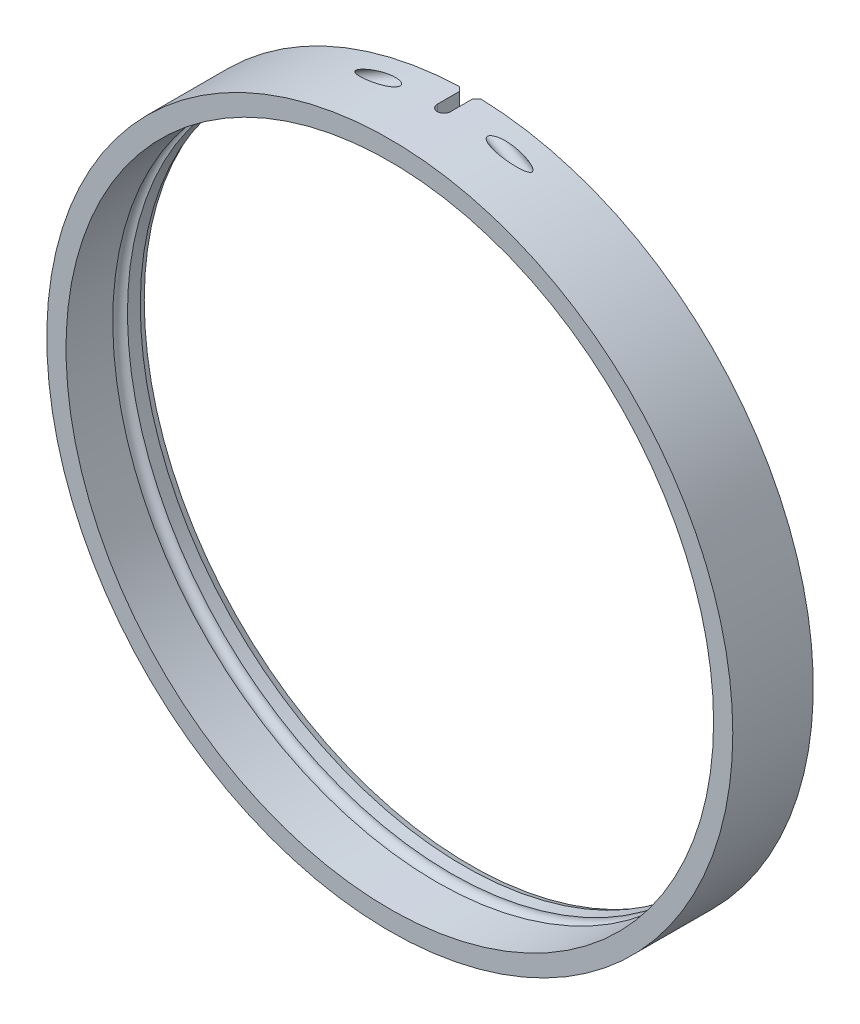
ISO-10303-21;
HEADER;
FILE_DESCRIPTION(('STEP AP214'),'2;1');
FILE_NAME('part.step','',(''),(''),'','','');
FILE_SCHEMA(('AUTOMOTIVE_DESIGN { 1 0 10303 214 1 1 1 1 }'));
ENDSEC;
DATA;
#1=APPLICATION_CONTEXT('core data for automotive mechanical design processes');
#2=APPLICATION_PROTOCOL_DEFINITION('international standard','automotive_design',2000,#1);
#3=PRODUCT_CONTEXT('',#1,'mechanical');
#4=PRODUCT('Part','Part','',(#3));
#5=PRODUCT_RELATED_PRODUCT_CATEGORY('part','',(#4));
#6=PRODUCT_DEFINITION_FORMATION('','',#4);
#7=PRODUCT_DEFINITION_CONTEXT('part definition',#1,'design');
#8=PRODUCT_DEFINITION('design','',#6,#7);
#9=PRODUCT_DEFINITION_SHAPE('','',#8);
#10=(LENGTH_UNIT() NAMED_UNIT(*) SI_UNIT(.MILLI.,.METRE.));
#11=(NAMED_UNIT(*) PLANE_ANGLE_UNIT() SI_UNIT($,.RADIAN.));
#12=(NAMED_UNIT(*) SI_UNIT($,.STERADIAN.) SOLID_ANGLE_UNIT());
#13=UNCERTAINTY_MEASURE_WITH_UNIT(LENGTH_MEASURE(1.E-05),#10,'distance_accuracy_value','');
#14=(GEOMETRIC_REPRESENTATION_CONTEXT(3) GLOBAL_UNCERTAINTY_ASSIGNED_CONTEXT((#13)) GLOBAL_UNIT_ASSIGNED_CONTEXT((#10,
#11,#12)) REPRESENTATION_CONTEXT('',''));
#15=CARTESIAN_POINT('',(0.,0.,0.));
#16=DIRECTION('',(0.,0.,1.));
#17=DIRECTION('',(1.,0.,0.));
#18=AXIS2_PLACEMENT_3D('',#15,#16,#17);
#19=CARTESIAN_POINT('',(0.,0.,-51.));
#20=DIRECTION('',(0.,0.,-0.999999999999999));
#21=DIRECTION('',(0.,0.999999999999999,0.));
#22=AXIS2_PLACEMENT_3D('',#19,#20,#21);
#23=CYLINDRICAL_SURFACE('',#22,78.5253999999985);
#24=CARTESIAN_POINT('',(0.,0.,-42.82));
#25=DIRECTION('',(0.,0.,-0.999999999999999));
#26=DIRECTION('',(0.,0.999999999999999,0.));
#27=AXIS2_PLACEMENT_3D('',#24,#25,#26);
#28=CIRCLE('',#27,78.5253999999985);
#29=CARTESIAN_POINT('',(-39.2626999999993,68.0049912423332,-42.82));
#30=VERTEX_POINT('',#29);
#31=CARTESIAN_POINT('',(39.2626999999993,68.0049912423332,-42.82));
#32=VERTEX_POINT('',#31);
#33=EDGE_CURVE('E242',#30,#32,#28,.T.);
#34=ORIENTED_EDGE('',*,*,#33,.T.);
#35=CARTESIAN_POINT('',(0.,0.,-42.82));
#36=DIRECTION('',(0.,0.,-0.999999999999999));
#37=DIRECTION('',(0.,0.999999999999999,0.));
#38=AXIS2_PLACEMENT_3D('',#35,#36,#37);
#39=CIRCLE('',#38,78.5253999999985);
#40=EDGE_CURVE('E310',#32,#30,#39,.T.);
#41=ORIENTED_EDGE('',*,*,#40,.T.);
#42=EDGE_LOOP('',(#34,#41));
#43=FACE_BOUND('',#42,.T.);
#44=CARTESIAN_POINT('',(1.38777878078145E-13,0.,-31.48));
#45=DIRECTION('',(0.,0.,0.999999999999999));
#46=DIRECTION('',(0.999999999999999,0.,0.));
#47=AXIS2_PLACEMENT_3D('',#44,#45,#46);
#48=CIRCLE('',#47,78.5253999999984);
#49=CARTESIAN_POINT('',(78.5253999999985,0.,-31.48));
#50=VERTEX_POINT('',#49);
#51=EDGE_CURVE('E400',#50,#50,#48,.T.);
#52=ORIENTED_EDGE('',*,*,#51,.T.);
#53=EDGE_LOOP('',(#52));
#54=FACE_BOUND('',#53,.T.);
#55=ADVANCED_FACE('F32',(#43,#54),#23,.F.);
#56=CARTESIAN_POINT('',(0.,0.,-44.6));
#57=DIRECTION('',(0.,0.,-0.999999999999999));
#58=DIRECTION('',(0.,1.,0.));
#59=AXIS2_PLACEMENT_3D('',#56,#57,#58);
#60=TOROIDAL_SURFACE('',#59,78.5253999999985,1.77999999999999);
#61=CARTESIAN_POINT('',(0.,0.,-46.3799999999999));
#62=DIRECTION('',(0.,0.,-0.999999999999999));
#63=DIRECTION('',(0.,0.999999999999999,0.));
#64=AXIS2_PLACEMENT_3D('',#61,#62,#63);
#65=CIRCLE('',#64,78.5253999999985);
#66=CARTESIAN_POINT('',(39.2626999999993,68.0049912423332,-46.3799999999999));
#67=VERTEX_POINT('',#66);
#68=CARTESIAN_POINT('',(-39.2626999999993,68.0049912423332,-46.3799999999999));
#69=VERTEX_POINT('',#68);
#70=EDGE_CURVE('E99',#67,#69,#65,.T.);
#71=ORIENTED_EDGE('',*,*,#70,.T.);
#72=CARTESIAN_POINT('',(-39.2626999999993,68.0049912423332,-44.5999999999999));
#73=DIRECTION('',(-0.866025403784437,-0.500000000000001,0.));
#74=DIRECTION('',(0.500000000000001,-0.866025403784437,0.));
#75=AXIS2_PLACEMENT_3D('',#72,#73,#74);
#76=CIRCLE('',#75,1.78);
#77=EDGE_CURVE('E249',#69,#30,#76,.F.);
#78=ORIENTED_EDGE('',*,*,#77,.T.);
#79=ORIENTED_EDGE('',*,*,#40,.F.);
#80=CARTESIAN_POINT('',(39.2626999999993,68.0049912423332,-44.5999999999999));
#81=DIRECTION('',(0.866025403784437,-0.500000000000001,0.));
#82=DIRECTION('',(0.500000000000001,0.866025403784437,0.));
#83=AXIS2_PLACEMENT_3D('',#80,#81,#82);
#84=CIRCLE('',#83,1.78000000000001);
#85=EDGE_CURVE('E246',#32,#67,#84,.F.);
#86=ORIENTED_EDGE('',*,*,#85,.T.);
#87=EDGE_LOOP('',(#71,#78,#79,#86));
#88=FACE_BOUND('',#87,.T.);
#89=ADVANCED_FACE('F308',(#88),#60,.F.);
#90=CARTESIAN_POINT('',(0.,0.,-44.6));
#91=DIRECTION('',(0.,0.,-0.999999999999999));
#92=DIRECTION('',(0.,1.,0.));
#93=AXIS2_PLACEMENT_3D('',#90,#91,#92);
#94=TOROIDAL_SURFACE('',#93,78.5253999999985,1.77999999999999);
#95=ORIENTED_EDGE('',*,*,#33,.F.);
#96=CARTESIAN_POINT('',(-39.2626999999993,68.0049912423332,-42.82));
#97=CARTESIAN_POINT('',(-39.0251412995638,68.1417544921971,-42.8200022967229));
#98=CARTESIAN_POINT('',(-38.7873193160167,68.2780618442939,-42.8200000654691));
#99=CARTESIAN_POINT('',(-38.3023144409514,68.5546140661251,-42.8200014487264));
#100=CARTESIAN_POINT('',(-38.0551089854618,68.694819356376,-42.8200052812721));
#101=CARTESIAN_POINT('',(-37.5511561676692,68.9788988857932,-42.8200363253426));
#102=CARTESIAN_POINT('',(-37.2943822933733,69.1227261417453,-42.8200643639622));
#103=CARTESIAN_POINT('',(-36.9052486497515,69.3391463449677,-42.8201502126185));
#104=CARTESIAN_POINT('',(-36.773208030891,69.4123135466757,-42.8201868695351));
#105=CARTESIAN_POINT('',(-36.515380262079,69.5546688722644,-42.8202786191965));
#106=CARTESIAN_POINT('',(-36.3896037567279,69.623876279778,-42.8203327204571));
#107=CARTESIAN_POINT('',(-36.0121743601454,69.8308871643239,-42.8205322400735));
#108=CARTESIAN_POINT('',(-35.7602409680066,69.9681796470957,-42.8207148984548));
#109=CARTESIAN_POINT('',(-35.2558478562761,70.2412587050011,-42.8212349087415));
#110=CARTESIAN_POINT('',(-35.0033887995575,70.377046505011,-42.8215721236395));
#111=CARTESIAN_POINT('',(-34.4979367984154,70.647137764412,-42.8224701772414));
#112=CARTESIAN_POINT('',(-34.2449444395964,70.7814423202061,-42.8230308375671));
#113=CARTESIAN_POINT('',(-33.7325160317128,71.051661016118,-42.8244715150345));
#114=CARTESIAN_POINT('',(-33.4730631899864,71.1875432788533,-42.825358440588));
#115=CARTESIAN_POINT('',(-32.9552577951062,71.4568769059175,-42.827541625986));
#116=CARTESIAN_POINT('',(-32.6969106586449,71.5903387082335,-42.8288349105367));
#117=CARTESIAN_POINT('',(-32.1813320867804,71.8548904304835,-42.8319371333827));
#118=CARTESIAN_POINT('',(-31.9241058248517,71.985990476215,-42.8337423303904));
#119=CARTESIAN_POINT('',(-31.4107781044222,72.2458644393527,-42.83798547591));
#120=CARTESIAN_POINT('',(-31.1546816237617,72.3746482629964,-42.8404188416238));
#121=CARTESIAN_POINT('',(-30.6436203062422,72.6299289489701,-42.8460466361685));
#122=CARTESIAN_POINT('',(-30.3886602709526,72.7564355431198,-42.8492355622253));
#123=CARTESIAN_POINT('',(-29.8798738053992,73.0071878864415,-42.8565122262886));
#124=CARTESIAN_POINT('',(-29.6260520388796,73.131443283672,-42.8605934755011));
#125=CARTESIAN_POINT('',(-29.1195446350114,73.3777155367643,-42.8698050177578));
#126=CARTESIAN_POINT('',(-28.8668635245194,73.4997419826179,-42.8749277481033));
#127=CARTESIAN_POINT('',(-28.3292101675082,73.7575549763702,-42.8871281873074));
#128=CARTESIAN_POINT('',(-28.04415156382,73.8931538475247,-42.8943702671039));
#129=CARTESIAN_POINT('',(-27.4820424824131,74.1584457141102,-42.9104817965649));
#130=CARTESIAN_POINT('',(-27.2050155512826,74.2881920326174,-42.9192943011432));
#131=CARTESIAN_POINT('',(-26.6590891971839,74.5419858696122,-42.9387250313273));
#132=CARTESIAN_POINT('',(-26.3902107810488,74.6660835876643,-42.9492770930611));
#133=CARTESIAN_POINT('',(-25.8606860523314,74.9087484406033,-42.9723631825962));
#134=CARTESIAN_POINT('',(-25.6000584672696,75.0273636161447,-42.984821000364));
#135=CARTESIAN_POINT('',(-25.0871307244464,75.2592007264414,-43.0118936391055));
#136=CARTESIAN_POINT('',(-24.8348471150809,75.3724693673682,-43.0264212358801));
#137=CARTESIAN_POINT('',(-24.3386950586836,75.5937216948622,-43.0578067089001));
#138=CARTESIAN_POINT('',(-24.0948410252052,75.7017516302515,-43.0745652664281));
#139=CARTESIAN_POINT('',(-23.6156210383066,75.9125814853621,-43.110570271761));
#140=CARTESIAN_POINT('',(-23.3802676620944,76.0154290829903,-43.1297045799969));
#141=CARTESIAN_POINT('',(-22.8525698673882,76.2444311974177,-43.1764468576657));
#142=CARTESIAN_POINT('',(-22.5601526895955,76.3702326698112,-43.2049857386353));
#143=CARTESIAN_POINT('',(-21.9994707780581,76.6095074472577,-43.2663242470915));
#144=CARTESIAN_POINT('',(-21.7312137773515,76.7231380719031,-43.2985743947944));
#145=CARTESIAN_POINT('',(-21.2191720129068,76.9384385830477,-43.3674260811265));
#146=CARTESIAN_POINT('',(-20.975365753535,77.0402616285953,-43.4033713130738));
#147=CARTESIAN_POINT('',(-20.619221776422,77.1879674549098,-43.462130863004));
#148=CARTESIAN_POINT('',(-20.5066129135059,77.234518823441,-43.481626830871));
#149=CARTESIAN_POINT('',(-20.2467538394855,77.3415849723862,-43.5291225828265));
#150=CARTESIAN_POINT('',(-20.0995830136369,77.4019563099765,-43.5578853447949));
#151=CARTESIAN_POINT('',(-19.7877196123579,77.5293571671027,-43.6239189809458));
#152=CARTESIAN_POINT('',(-19.6231116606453,77.5962864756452,-43.6618021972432));
#153=CARTESIAN_POINT('',(-19.385037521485,77.692640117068,-43.7229131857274));
#154=CARTESIAN_POINT('',(-19.3109278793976,77.7225703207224,-43.7428348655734));
#155=CARTESIAN_POINT('',(-19.1681954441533,77.7800938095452,-43.7833466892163));
#156=CARTESIAN_POINT('',(-19.0995421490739,77.8077076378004,-43.8037993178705));
#157=CARTESIAN_POINT('',(-18.9541555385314,77.8660612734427,-43.8496275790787));
#158=CARTESIAN_POINT('',(-18.8774962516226,77.8967556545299,-43.8752987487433));
#159=CARTESIAN_POINT('',(-18.732836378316,77.9545401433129,-43.9275465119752));
#160=CARTESIAN_POINT('',(-18.6647348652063,77.9816843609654,-43.9537773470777));
#161=CARTESIAN_POINT('',(-18.5664011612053,78.0208016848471,-43.9949675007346));
#162=CARTESIAN_POINT('',(-18.5356123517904,78.0330382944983,-44.0083480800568));
#163=CARTESIAN_POINT('',(-18.4762122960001,78.0566254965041,-44.0352917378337));
#164=CARTESIAN_POINT('',(-18.4475793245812,78.0679859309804,-44.0487979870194));
#165=CARTESIAN_POINT('',(-18.392497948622,78.0898230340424,-44.075988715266));
#166=CARTESIAN_POINT('',(-18.3660235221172,78.1003110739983,-44.0896111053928));
#167=CARTESIAN_POINT('',(-18.3152654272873,78.1204054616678,-44.1170330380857));
#168=CARTESIAN_POINT('',(-18.2909505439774,78.1300250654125,-44.1307645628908));
#169=CARTESIAN_POINT('',(-18.2518136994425,78.1454994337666,-44.1540635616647));
#170=CARTESIAN_POINT('',(-18.2368155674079,78.1514273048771,-44.1632865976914));
#171=CARTESIAN_POINT('',(-18.2077948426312,78.1628934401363,-44.1817996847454));
#172=CARTESIAN_POINT('',(-18.1937594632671,78.1684369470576,-44.191066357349));
#173=CARTESIAN_POINT('',(-18.1666665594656,78.1791344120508,-44.2096654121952));
#174=CARTESIAN_POINT('',(-18.1535944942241,78.1842942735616,-44.2189731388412));
#175=CARTESIAN_POINT('',(-18.1284306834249,78.1942243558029,-44.2376534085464));
#176=CARTESIAN_POINT('',(-18.1163224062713,78.1990012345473,-44.2470000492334));
#177=CARTESIAN_POINT('',(-18.0930887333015,78.2081651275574,-44.2657571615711));
#178=CARTESIAN_POINT('',(-18.0819445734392,78.2125596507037,-44.2751406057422));
#179=CARTESIAN_POINT('',(-18.0606422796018,78.2209582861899,-44.2939698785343));
#180=CARTESIAN_POINT('',(-18.0504628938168,78.2249708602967,-44.3033877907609));
#181=CARTESIAN_POINT('',(-18.0310921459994,78.2326054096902,-44.3222854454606));
#182=CARTESIAN_POINT('',(-18.0218769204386,78.2362368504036,-44.3317366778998));
#183=CARTESIAN_POINT('',(-18.0086273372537,78.2414575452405,-44.3461440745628));
#184=CARTESIAN_POINT('',(-18.0043889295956,78.243127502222,-44.3508842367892));
#185=CARTESIAN_POINT('',(-17.9961573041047,78.2463706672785,-44.3603754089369));
#186=CARTESIAN_POINT('',(-17.9921605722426,78.2479452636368,-44.3651228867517));
#187=CARTESIAN_POINT('',(-17.9844125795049,78.2509976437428,-44.3746281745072));
#188=CARTESIAN_POINT('',(-17.9806576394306,78.2524768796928,-44.3793825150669));
#189=CARTESIAN_POINT('',(-17.9733934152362,78.2553385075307,-44.3889012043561));
#190=CARTESIAN_POINT('',(-17.9698803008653,78.2567224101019,-44.3936621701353));
#191=CARTESIAN_POINT('',(-17.9630999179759,78.2593933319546,-44.4031936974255));
#192=CARTESIAN_POINT('',(-17.959828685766,78.2606819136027,-44.4079609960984));
#193=CARTESIAN_POINT('',(-17.953532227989,78.2631621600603,-44.4175047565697));
#194=CARTESIAN_POINT('',(-17.9505029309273,78.2643554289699,-44.4222781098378));
#195=CARTESIAN_POINT('',(-17.9446904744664,78.2666450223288,-44.4318335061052));
#196=CARTESIAN_POINT('',(-17.9419031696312,78.2677429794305,-44.4366126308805));
#197=CARTESIAN_POINT('',(-17.9365747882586,78.269841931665,-44.4461790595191));
#198=CARTESIAN_POINT('',(-17.9340295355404,78.2708445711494,-44.4509636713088));
#199=CARTESIAN_POINT('',(-17.929185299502,78.2727528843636,-44.4605405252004));
#200=CARTESIAN_POINT('',(-17.9268821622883,78.2736601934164,-44.4653303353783));
#201=CARTESIAN_POINT('',(-17.9225221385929,78.2753778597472,-44.4749170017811));
#202=CARTESIAN_POINT('',(-17.9204611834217,78.2761898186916,-44.4797117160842));
#203=CARTESIAN_POINT('',(-17.9165854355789,78.2777168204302,-44.4893075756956));
#204=CARTESIAN_POINT('',(-17.9147667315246,78.2784334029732,-44.4941068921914));
#205=CARTESIAN_POINT('',(-17.9113753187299,78.2797697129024,-44.5037113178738));
#206=CARTESIAN_POINT('',(-17.9097989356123,78.2803908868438,-44.5085149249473));
#207=CARTESIAN_POINT('',(-17.9068919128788,78.2815364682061,-44.5181272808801));
#208=CARTESIAN_POINT('',(-17.905557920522,78.2820621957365,-44.5229348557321));
#209=CARTESIAN_POINT('',(-17.9031353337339,78.2830170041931,-44.5325544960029));
#210=CARTESIAN_POINT('',(-17.9020437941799,78.2834472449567,-44.5373657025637));
#211=CARTESIAN_POINT('',(-17.9001056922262,78.2842112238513,-44.5469919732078));
#212=CARTESIAN_POINT('',(-17.8992566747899,78.2845459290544,-44.5518064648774));
#213=CARTESIAN_POINT('',(-17.8978030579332,78.2851190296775,-44.5614386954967));
#214=CARTESIAN_POINT('',(-17.8971965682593,78.2853581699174,-44.5662561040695));
#215=CARTESIAN_POINT('',(-17.8962275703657,78.2857402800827,-44.5758936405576));
#216=CARTESIAN_POINT('',(-17.8958637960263,78.2858837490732,-44.5807136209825));
#217=CARTESIAN_POINT('',(-17.8953790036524,78.2860749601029,-44.5903557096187));
#218=CARTESIAN_POINT('',(-17.895257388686,78.2861229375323,-44.5951777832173));
#219=CARTESIAN_POINT('',(-17.8952578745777,78.286122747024,-44.5999999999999));
#220=B_SPLINE_CURVE_WITH_KNOTS('',3,(#96,#97,#98,#99,#100,#101,#102,#103,#104,#105,#106,#107,
#108,#109,#110,#111,#112,#113,#114,#115,#116,#117,#118,#119,#120,#121,#122,#123,#124,#125,#126,
#127,#128,#129,#130,#131,#132,#133,#134,#135,#136,#137,#138,#139,#140,#141,#142,#143,#144,#145,
#146,#147,#148,#149,#150,#151,#152,#153,#154,#155,#156,#157,#158,#159,#160,#161,#162,#163,#164,
#165,#166,#167,#168,#169,#170,#171,#172,#173,#174,#175,#176,#177,#178,#179,#180,#181,#182,#183,
#184,#185,#186,#187,#188,#189,#190,#191,#192,#193,#194,#195,#196,#197,#198,#199,#200,#201,#202,
#203,#204,#205,#206,#207,#208,#209,#210,#211,#212,#213,#214,#215,#216,#217,#218,#219),
.UNSPECIFIED.,.F.,.F.,(4,2,2,2,2,2,2,2,2,2,2,2,2,2,2,2,2,2,2,2,2,2,2,2,2,2,2,2,2,2,2,2,2,2,2,2,
2,2,2,2,2,2,2,2,2,2,2,2,2,2,2,2,2,2,2,2,2,2,2,2,2,4),(0.,0.822341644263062,1.67493024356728,
2.55785846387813,3.01073028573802,3.44140901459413,4.30214661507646,5.16212268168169,
6.02141359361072,6.90005817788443,7.77241376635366,8.63855120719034,9.49854004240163,
10.3524482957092,11.2003422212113,12.0422860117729,12.9895243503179,13.9076096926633,
14.7965657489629,15.6564141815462,16.4871753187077,17.2888690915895,18.0615162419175,
19.0202689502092,19.8995268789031,20.6993527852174,21.0695415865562,21.5544519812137,
22.0993484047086,22.3464384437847,22.5767306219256,22.8360937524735,23.0695848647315,
23.176765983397,23.2776548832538,23.3723367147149,23.4609155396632,23.5166422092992,
23.5697583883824,23.6203166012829,23.6683779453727,23.7140137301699,23.7573074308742,
23.798356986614,23.8180775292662,23.8372818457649,23.8559874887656,23.8742134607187,
23.8919803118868,23.9093102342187,23.9262271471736,23.9427567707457,23.9589266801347,
23.974766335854,23.9903070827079,24.005582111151,24.0206263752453,24.0354764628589,
24.0501704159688,24.0647475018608,24.0792479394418,24.0937125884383),.UNSPECIFIED.);
#221=CARTESIAN_POINT('',(-17.8952578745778,78.286122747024,-44.5999999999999));
#222=VERTEX_POINT('',#221);
#223=EDGE_CURVE('E247',#30,#222,#220,.T.);
#224=ORIENTED_EDGE('',*,*,#223,.T.);
#225=CARTESIAN_POINT('',(-17.8952578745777,78.286122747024,-44.5999999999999));
#226=CARTESIAN_POINT('',(-17.8952573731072,78.2861229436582,-44.6048617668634));
#227=CARTESIAN_POINT('',(-17.8953809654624,78.2860741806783,-44.6097233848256));
#228=CARTESIAN_POINT('',(-17.8958736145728,78.2858798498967,-44.6194445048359));
#229=CARTESIAN_POINT('',(-17.8962432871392,78.285734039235,-44.6243039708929));
#230=CARTESIAN_POINT('',(-17.8972279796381,78.2853457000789,-44.6340204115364));
#231=CARTESIAN_POINT('',(-17.8978443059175,78.2851026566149,-44.6388772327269));
#232=CARTESIAN_POINT('',(-17.8993214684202,78.2845202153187,-44.6485882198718));
#233=CARTESIAN_POINT('',(-17.9001842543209,78.2841800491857,-44.6534420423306));
#234=CARTESIAN_POINT('',(-17.9021537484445,78.2834036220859,-44.6631469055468));
#235=CARTESIAN_POINT('',(-17.9032629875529,78.2829663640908,-44.6679973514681));
#236=CARTESIAN_POINT('',(-17.9057248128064,78.2819960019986,-44.6776954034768));
#237=CARTESIAN_POINT('',(-17.9070804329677,78.2814617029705,-44.6825421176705));
#238=CARTESIAN_POINT('',(-17.9100345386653,78.2802974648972,-44.6922326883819));
#239=CARTESIAN_POINT('',(-17.9116364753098,78.2796661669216,-44.6970753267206));
#240=CARTESIAN_POINT('',(-17.9150828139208,78.2783080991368,-44.706757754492));
#241=CARTESIAN_POINT('',(-17.9169309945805,78.2775798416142,-44.7115959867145));
#242=CARTESIAN_POINT('',(-17.9208695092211,78.2760279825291,-44.7212696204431));
#243=CARTESIAN_POINT('',(-17.9229638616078,78.2752027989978,-44.7261031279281));
#244=CARTESIAN_POINT('',(-17.9273944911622,78.2734571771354,-44.7357673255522));
#245=CARTESIAN_POINT('',(-17.9297349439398,78.2725350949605,-44.7405957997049));
#246=CARTESIAN_POINT('',(-17.9346576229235,78.2705957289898,-44.7502499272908));
#247=CARTESIAN_POINT('',(-17.937244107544,78.2695767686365,-44.7550730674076));
#248=CARTESIAN_POINT('',(-17.9426587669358,78.2674436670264,-44.7647164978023));
#249=CARTESIAN_POINT('',(-17.9454912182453,78.2663278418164,-44.7695340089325));
#250=CARTESIAN_POINT('',(-17.9513977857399,78.2640010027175,-44.7791661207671));
#251=CARTESIAN_POINT('',(-17.9544761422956,78.2627883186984,-44.7839777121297));
#252=CARTESIAN_POINT('',(-17.9608745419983,78.2602677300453,-44.7935978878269));
#253=CARTESIAN_POINT('',(-17.9641987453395,78.2589581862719,-44.7984032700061));
#254=CARTESIAN_POINT('',(-17.9710888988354,78.2562438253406,-44.8080108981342));
#255=CARTESIAN_POINT('',(-17.9746588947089,78.2548374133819,-44.8128097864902));
#256=CARTESIAN_POINT('',(-17.9820407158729,78.2519292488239,-44.8224042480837));
#257=CARTESIAN_POINT('',(-17.9858564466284,78.2504259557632,-44.82719634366));
#258=CARTESIAN_POINT('',(-17.9937298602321,78.2473239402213,-44.836777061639));
#259=CARTESIAN_POINT('',(-17.9977912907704,78.2457237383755,-44.8415621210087));
#260=CARTESIAN_POINT('',(-18.0061561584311,78.2424278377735,-44.8511283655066));
#261=CARTESIAN_POINT('',(-18.0104631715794,78.2407307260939,-44.8559059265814));
#262=CARTESIAN_POINT('',(-18.0239286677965,78.2354245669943,-44.8704284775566));
#263=CARTESIAN_POINT('',(-18.0332930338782,78.2317340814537,-44.8799537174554));
#264=CARTESIAN_POINT('',(-18.0529772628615,78.2239753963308,-44.898999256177));
#265=CARTESIAN_POINT('',(-18.0633213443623,78.2198975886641,-44.9084903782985));
#266=CARTESIAN_POINT('',(-18.0849683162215,78.2113623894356,-44.9274658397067));
#267=CARTESIAN_POINT('',(-18.0962927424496,78.2068964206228,-44.9369216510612));
#268=CARTESIAN_POINT('',(-18.1199022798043,78.1975835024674,-44.9558231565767));
#269=CARTESIAN_POINT('',(-18.1322063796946,78.1927289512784,-44.9652412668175));
#270=CARTESIAN_POINT('',(-18.157777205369,78.1826373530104,-44.9840640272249));
#271=CARTESIAN_POINT('',(-18.1710606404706,78.1773935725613,-44.9934422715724));
#272=CARTESIAN_POINT('',(-18.1985916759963,78.1665220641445,-45.0121818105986));
#273=CARTESIAN_POINT('',(-18.2128539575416,78.1608883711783,-45.0215179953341));
#274=CARTESIAN_POINT('',(-18.242343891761,78.1492356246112,-45.0401694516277));
#275=CARTESIAN_POINT('',(-18.2575844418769,78.1432112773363,-45.0494609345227));
#276=CARTESIAN_POINT('',(-18.2973557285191,78.1274842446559,-45.0729332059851));
#277=CARTESIAN_POINT('',(-18.3220633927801,78.1177080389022,-45.0867649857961));
#278=CARTESIAN_POINT('',(-18.3736415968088,78.0972862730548,-45.1143858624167));
#279=CARTESIAN_POINT('',(-18.400543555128,78.0866273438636,-45.128105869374));
#280=CARTESIAN_POINT('',(-18.4565145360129,78.0644341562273,-45.1554899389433));
#281=CARTESIAN_POINT('',(-18.4856097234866,78.0528884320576,-45.1690909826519));
#282=CARTESIAN_POINT('',(-18.545968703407,78.0289162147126,-45.1962220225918));
#283=CARTESIAN_POINT('',(-18.5772543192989,78.0164797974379,-45.2096943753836));
#284=CARTESIAN_POINT('',(-18.6771812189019,77.9767206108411,-45.2511668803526));
#285=CARTESIAN_POINT('',(-18.7463799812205,77.9491326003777,-45.2775698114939));
#286=CARTESIAN_POINT('',(-18.8933710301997,77.890401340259,-45.3301527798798));
#287=CARTESIAN_POINT('',(-18.9712644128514,77.8592034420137,-45.3559825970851));
#288=CARTESIAN_POINT('',(-19.1179863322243,77.8002937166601,-45.4017723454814));
#289=CARTESIAN_POINT('',(-19.1867331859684,77.7726326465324,-45.4220625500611));
#290=CARTESIAN_POINT('',(-19.3295808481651,77.7150423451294,-45.4622479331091));
#291=CARTESIAN_POINT('',(-19.4037109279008,77.6850931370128,-45.4820096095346));
#292=CARTESIAN_POINT('',(-19.6416431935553,77.5887621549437,-45.5425991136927));
#293=CARTESIAN_POINT('',(-19.8060703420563,77.5218822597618,-45.5801795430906));
#294=CARTESIAN_POINT('',(-20.1174008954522,77.3946545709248,-45.6456783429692));
#295=CARTESIAN_POINT('',(-20.2642209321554,77.3344068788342,-45.6742063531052));
#296=CARTESIAN_POINT('',(-20.5235324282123,77.2275320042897,-45.7213463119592));
#297=CARTESIAN_POINT('',(-20.6359466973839,77.1810465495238,-45.7407094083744));
#298=CARTESIAN_POINT('',(-20.9913102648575,77.0336189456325,-45.7990543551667));
#299=CARTESIAN_POINT('',(-21.2345233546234,76.9320136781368,-45.8347599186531));
#300=CARTESIAN_POINT('',(-21.7451134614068,76.7172635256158,-45.9031489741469));
#301=CARTESIAN_POINT('',(-22.0125110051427,76.6039677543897,-45.9351884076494));
#302=CARTESIAN_POINT('',(-22.5712120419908,76.3654830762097,-45.9961270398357));
#303=CARTESIAN_POINT('',(-22.8625075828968,76.2401392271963,-46.0244864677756));
#304=CARTESIAN_POINT('',(-23.3889405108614,76.0116490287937,-46.0710188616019));
#305=CARTESIAN_POINT('',(-23.6241494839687,75.9088486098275,-46.0901025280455));
#306=CARTESIAN_POINT('',(-24.1030466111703,75.6981289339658,-46.1260120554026));
#307=CARTESIAN_POINT('',(-24.3467222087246,75.5901622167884,-46.1427265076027));
#308=CARTESIAN_POINT('',(-24.8424837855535,75.3690525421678,-46.17402930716));
#309=CARTESIAN_POINT('',(-25.0945553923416,75.2558635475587,-46.1885189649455));
#310=CARTESIAN_POINT('',(-25.6070259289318,75.0242024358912,-46.2155210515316));
#311=CARTESIAN_POINT('',(-25.8674083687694,74.9056838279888,-46.227946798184));
#312=CARTESIAN_POINT('',(-26.396410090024,74.6632294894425,-46.2509737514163));
#313=CARTESIAN_POINT('',(-26.6650107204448,74.5392459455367,-46.2614992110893));
#314=CARTESIAN_POINT('',(-27.2103493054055,74.2856986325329,-46.2808813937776));
#315=CARTESIAN_POINT('',(-27.4870663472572,74.1560849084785,-46.2896723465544));
#316=CARTESIAN_POINT('',(-28.0485240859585,73.8910774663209,-46.3057450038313));
#317=CARTESIAN_POINT('',(-28.3332413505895,73.7556306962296,-46.3129700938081));
#318=CARTESIAN_POINT('',(-28.8703744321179,73.4980503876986,-46.3251458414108));
#319=CARTESIAN_POINT('',(-29.1228760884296,73.3761033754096,-46.3302597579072));
#320=CARTESIAN_POINT('',(-29.6290190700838,73.129994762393,-46.3394558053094));
#321=CARTESIAN_POINT('',(-29.8826558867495,73.0058236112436,-46.3435304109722));
#322=CARTESIAN_POINT('',(-30.391067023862,72.7552447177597,-46.3507955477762));
#323=CARTESIAN_POINT('',(-30.6458366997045,72.6288273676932,-46.3539796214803));
#324=CARTESIAN_POINT('',(-31.1565119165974,72.3737302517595,-46.3595991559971));
#325=CARTESIAN_POINT('',(-31.4124126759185,72.2450407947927,-46.3620291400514));
#326=CARTESIAN_POINT('',(-31.925343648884,71.9853608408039,-46.3662666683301));
#327=CARTESIAN_POINT('',(-32.1823689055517,71.8543604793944,-46.368069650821));
#328=CARTESIAN_POINT('',(-32.6975402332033,71.5900135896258,-46.3711683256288));
#329=CARTESIAN_POINT('',(-32.9556811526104,71.4566569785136,-46.3724602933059));
#330=CARTESIAN_POINT('',(-33.4730690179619,71.1875395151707,-46.3746414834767));
#331=CARTESIAN_POINT('',(-33.7323105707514,71.0517682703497,-46.3755277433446));
#332=CARTESIAN_POINT('',(-34.2443770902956,70.7817425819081,-46.3769677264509));
#333=CARTESIAN_POINT('',(-34.4972186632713,70.6475196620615,-46.3775282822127));
#334=CARTESIAN_POINT('',(-35.0023609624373,70.3775979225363,-46.3784262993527));
#335=CARTESIAN_POINT('',(-35.2546611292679,70.2418980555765,-46.3787635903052));
#336=CARTESIAN_POINT('',(-35.7587285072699,69.9690014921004,-46.3792838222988));
#337=CARTESIAN_POINT('',(-36.0104950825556,69.8318036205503,-46.3794666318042));
#338=CARTESIAN_POINT('',(-36.3876717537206,69.6249380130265,-46.3796663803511));
#339=CARTESIAN_POINT('',(-36.5133619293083,69.555780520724,-46.3797205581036));
#340=CARTESIAN_POINT('',(-36.7712084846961,69.4134201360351,-46.3798125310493));
#341=CARTESIAN_POINT('',(-36.9033539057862,69.3401973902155,-46.3798493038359));
#342=CARTESIAN_POINT('',(-37.2927977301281,69.1236114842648,-46.3799354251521));
#343=CARTESIAN_POINT('',(-37.5497764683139,68.9796731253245,-46.379963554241));
#344=CARTESIAN_POINT('',(-38.0541329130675,68.6953716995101,-46.3799946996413));
#345=CARTESIAN_POINT('',(-38.3015371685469,68.5550556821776,-46.3799985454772));
#346=CARTESIAN_POINT('',(-38.7869338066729,68.2782826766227,-46.3799999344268));
#347=CARTESIAN_POINT('',(-39.0249487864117,68.1418653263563,-46.3799976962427));
#348=CARTESIAN_POINT('',(-39.2626999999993,68.0049912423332,-46.3799999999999));
#349=B_SPLINE_CURVE_WITH_KNOTS('',3,(#225,#226,#227,#228,#229,#230,#231,#232,#233,#234,#235,
#236,#237,#238,#239,#240,#241,#242,#243,#244,#245,#246,#247,#248,#249,#250,#251,#252,#253,#254,
#255,#256,#257,#258,#259,#260,#261,#262,#263,#264,#265,#266,#267,#268,#269,#270,#271,#272,#273,
#274,#275,#276,#277,#278,#279,#280,#281,#282,#283,#284,#285,#286,#287,#288,#289,#290,#291,#292,
#293,#294,#295,#296,#297,#298,#299,#300,#301,#302,#303,#304,#305,#306,#307,#308,#309,#310,#311,
#312,#313,#314,#315,#316,#317,#318,#319,#320,#321,#322,#323,#324,#325,#326,#327,#328,#329,#330,
#331,#332,#333,#334,#335,#336,#337,#338,#339,#340,#341,#342,#343,#344,#345,#346,#347,#348),
.UNSPECIFIED.,.F.,.F.,(4,2,2,2,2,2,2,2,2,2,2,2,2,2,2,2,2,2,2,2,2,2,2,2,2,2,2,2,2,2,2,2,2,2,2,2,
2,2,2,2,2,2,2,2,2,2,2,2,2,2,2,2,2,2,2,2,2,2,2,2,2,4),(0.,0.0145832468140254,0.029203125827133,
0.043901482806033,0.058719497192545,0.0736973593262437,0.0888739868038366,0.104286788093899,
0.119971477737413,0.135961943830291,0.152290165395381,0.168986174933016,0.186078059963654,
0.203591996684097,0.221552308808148,0.239981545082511,0.258900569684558,0.278328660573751,
0.298283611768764,0.33983465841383,0.38367460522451,0.429902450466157,0.47860247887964,
0.529846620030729,0.583696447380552,0.64020485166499,0.730047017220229,0.826101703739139,
0.92847343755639,1.03724767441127,1.27425647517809,1.53757980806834,1.76804589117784,
2.01509689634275,2.55926349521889,3.04295323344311,3.41247220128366,4.21032716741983,
5.08676768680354,6.04185445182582,6.81403800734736,7.61515847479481,8.4452365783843,
9.30429227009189,10.1923459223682,11.1094192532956,12.0555360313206,12.8968910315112,
13.7441752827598,14.5974528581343,15.4567898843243,16.3222542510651,17.1939153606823,
18.0718439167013,18.9306204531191,19.7900517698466,20.6502141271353,21.0805937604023,
21.5338213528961,22.4174486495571,23.270719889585,24.0937279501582),.UNSPECIFIED.);
#350=EDGE_CURVE('E95',#222,#69,#349,.T.);
#351=ORIENTED_EDGE('',*,*,#350,.T.);
#352=CARTESIAN_POINT('',(0.,0.,-46.3799999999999));
#353=DIRECTION('',(0.,0.,-0.999999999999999));
#354=DIRECTION('',(0.,0.999999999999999,0.));
#355=AXIS2_PLACEMENT_3D('',#352,#353,#354);
#356=CIRCLE('',#355,78.5253999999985);
#357=CARTESIAN_POINT('',(-1.58749999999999,78.509351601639,-46.3799999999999));
#358=VERTEX_POINT('',#357);
#359=EDGE_CURVE('E85',#69,#358,#356,.T.);
#360=ORIENTED_EDGE('',*,*,#359,.T.);
#361=CARTESIAN_POINT('',(-1.58750000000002,80.289707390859,-44.6000000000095));
#362=CARTESIAN_POINT('',(-1.5875,80.2897070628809,-44.6500727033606));
#363=CARTESIAN_POINT('',(-1.58749999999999,80.2875927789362,-44.7001214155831));
#364=CARTESIAN_POINT('',(-1.58749999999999,80.279158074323,-44.7998606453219));
#365=CARTESIAN_POINT('',(-1.58749999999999,80.2728378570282,-44.8495511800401));
#366=CARTESIAN_POINT('',(-1.58749999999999,80.2476284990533,-44.9974641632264));
#367=CARTESIAN_POINT('',(-1.58749999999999,80.2224904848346,-45.094695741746));
#368=CARTESIAN_POINT('',(-1.58749999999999,80.1562486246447,-45.2835556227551));
#369=CARTESIAN_POINT('',(-1.58749999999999,80.1151371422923,-45.375181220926));
#370=CARTESIAN_POINT('',(-1.58749999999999,80.0181205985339,-45.55022816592));
#371=CARTESIAN_POINT('',(-1.58749999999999,79.9622181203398,-45.63365094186));
#372=CARTESIAN_POINT('',(-1.58749999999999,79.8372011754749,-45.7899324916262));
#373=CARTESIAN_POINT('',(-1.58749999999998,79.7680857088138,-45.8627904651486));
#374=CARTESIAN_POINT('',(-1.5875,79.6185896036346,-45.9958869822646));
#375=CARTESIAN_POINT('',(-1.58750000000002,79.5382067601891,-46.056123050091));
#376=CARTESIAN_POINT('',(-1.58750000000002,79.3684478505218,-46.1622670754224));
#377=CARTESIAN_POINT('',(-1.58749999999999,79.2790683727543,-46.2081695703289));
#378=CARTESIAN_POINT('',(-1.58749999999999,79.0938900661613,-46.2842969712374));
#379=CARTESIAN_POINT('',(-1.58750000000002,78.9980950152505,-46.3145310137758));
#380=CARTESIAN_POINT('',(-1.58750000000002,78.8363217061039,-46.3509624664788));
#381=CARTESIAN_POINT('',(-1.5875,78.7713598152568,-46.3618449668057));
#382=CARTESIAN_POINT('',(-1.58749999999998,78.6407248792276,-46.3763627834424));
#383=CARTESIAN_POINT('',(-1.58749999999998,78.575052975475,-46.3800083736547));
#384=CARTESIAN_POINT('',(-1.58750000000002,78.509351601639,-46.3799999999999));
#385=B_SPLINE_CURVE_WITH_KNOTS('',3,(#361,#362,#363,#364,#365,#366,#367,#368,#369,#370,#371,
#372,#373,#374,#375,#376,#377,#378,#379,#380,#381,#382,#383,#384),.UNSPECIFIED.,.F.,.F.,(4,2,2,
2,2,2,2,2,2,2,2,4),(0.,0.150125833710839,0.300244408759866,0.599984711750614,0.89986848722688,
1.19969992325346,1.49955406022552,1.79946695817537,2.0994940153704,2.39934592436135,
2.59657179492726,2.79351747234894),.UNSPECIFIED.);
#386=CARTESIAN_POINT('',(-1.58750000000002,80.289707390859,-44.6000000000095));
#387=VERTEX_POINT('',#386);
#388=EDGE_CURVE('E90',#387,#358,#385,.T.);
#389=ORIENTED_EDGE('',*,*,#388,.F.);
#390=CARTESIAN_POINT('',(-1.58750000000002,80.289707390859,-44.6000000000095));
#391=CARTESIAN_POINT('',(-1.58750863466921,80.2897160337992,-44.5627115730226));
#392=CARTESIAN_POINT('',(-1.58618650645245,80.2885617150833,-44.525429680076));
#393=CARTESIAN_POINT('',(-1.58094734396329,80.283993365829,-44.4512136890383));
#394=CARTESIAN_POINT('',(-1.57703214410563,80.2805809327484,-44.4142793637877));
#395=CARTESIAN_POINT('',(-1.56671390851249,80.2715977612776,-44.3413268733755));
#396=CARTESIAN_POINT('',(-1.56033062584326,80.266044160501,-44.3053037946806));
#397=CARTESIAN_POINT('',(-1.54519612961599,80.2528988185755,-44.2341444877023));
#398=CARTESIAN_POINT('',(-1.53644461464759,80.2453068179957,-44.1990083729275));
#399=CARTESIAN_POINT('',(-1.50689373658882,80.2197253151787,-44.0954632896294));
#400=CARTESIAN_POINT('',(-1.48276080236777,80.1988976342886,-44.0286638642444));
#401=CARTESIAN_POINT('',(-1.42688675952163,80.1510169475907,-43.9006764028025));
#402=CARTESIAN_POINT('',(-1.3951302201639,80.1239513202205,-43.8395001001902));
#403=CARTESIAN_POINT('',(-1.31196681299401,80.0537846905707,-43.7013091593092));
#404=CARTESIAN_POINT('',(-1.25768200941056,80.0085021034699,-43.6271339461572));
#405=CARTESIAN_POINT('',(-1.13954168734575,79.9121779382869,-43.4910534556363));
#406=CARTESIAN_POINT('',(-1.0756657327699,79.86112412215,-43.429175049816));
#407=CARTESIAN_POINT('',(-0.973075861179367,79.7822719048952,-43.344894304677));
#408=CARTESIAN_POINT('',(-0.937325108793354,79.7553048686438,-43.3179808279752));
#409=CARTESIAN_POINT('',(-0.863738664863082,79.7012721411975,-43.2672927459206));
#410=CARTESIAN_POINT('',(-0.825903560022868,79.6742064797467,-43.2435172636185));
#411=CARTESIAN_POINT('',(-0.748130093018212,79.620606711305,-43.1991211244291));
#412=CARTESIAN_POINT('',(-0.708193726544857,79.5940721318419,-43.1784975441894));
#413=CARTESIAN_POINT('',(-0.626027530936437,79.5423357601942,-43.1404473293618));
#414=CARTESIAN_POINT('',(-0.58379923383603,79.5171330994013,-43.1230185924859));
#415=CARTESIAN_POINT('',(-0.493357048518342,79.467343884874,-43.0902820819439));
#416=CARTESIAN_POINT('',(-0.444932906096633,79.442956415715,-43.0752433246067));
#417=CARTESIAN_POINT('',(-0.344723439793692,79.3993500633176,-43.0495220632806));
#418=CARTESIAN_POINT('',(-0.292946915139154,79.3801182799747,-43.0388286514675));
#419=CARTESIAN_POINT('',(-0.200862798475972,79.35414153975,-43.0247724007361));
#420=CARTESIAN_POINT('',(-0.161313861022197,79.3454174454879,-43.0202025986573));
#421=CARTESIAN_POINT('',(-0.0811659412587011,79.3336233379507,-43.014070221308));
#422=CARTESIAN_POINT('',(-0.0405690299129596,79.3305429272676,-43.012502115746));
#423=CARTESIAN_POINT('',(0.0245940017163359,79.3305315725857,-43.0124987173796));
#424=CARTESIAN_POINT('',(0.0491777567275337,79.3316567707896,-43.0130729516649));
#425=CARTESIAN_POINT('',(0.0981000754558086,79.3360676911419,-43.0153447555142));
#426=CARTESIAN_POINT('',(0.122438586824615,79.3393538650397,-43.0170425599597));
#427=CARTESIAN_POINT('',(0.194900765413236,79.3522027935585,-43.0237633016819));
#428=CARTESIAN_POINT('',(0.242360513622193,79.364754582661,-43.0304132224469));
#429=CARTESIAN_POINT('',(0.322377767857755,79.3914357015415,-43.0451920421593));
#430=CARTESIAN_POINT('',(0.355563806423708,79.4042754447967,-43.0524680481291));
#431=CARTESIAN_POINT('',(0.420543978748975,79.432173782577,-43.0688501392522));
#432=CARTESIAN_POINT('',(0.45233722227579,79.4472337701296,-43.077957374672));
#433=CARTESIAN_POINT('',(0.51467142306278,79.4789428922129,-43.0978866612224));
#434=CARTESIAN_POINT('',(0.545208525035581,79.4955964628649,-43.1087135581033));
#435=CARTESIAN_POINT('',(0.605059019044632,79.529954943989,-43.1319774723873));
#436=CARTESIAN_POINT('',(0.63437199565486,79.54766020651,-43.1444150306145));
#437=CARTESIAN_POINT('',(0.710343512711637,79.5953219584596,-43.1793406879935));
#438=CARTESIAN_POINT('',(0.756045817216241,79.6258409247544,-43.2031519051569));
#439=CARTESIAN_POINT('',(0.84467695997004,79.6874435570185,-43.2548941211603));
#440=CARTESIAN_POINT('',(0.887604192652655,79.7185275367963,-43.2828274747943));
#441=CARTESIAN_POINT('',(0.970661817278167,79.7803352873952,-43.3427847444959));
#442=CARTESIAN_POINT('',(1.01079617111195,79.8110595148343,-43.3748026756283));
#443=CARTESIAN_POINT('',(1.08820299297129,79.8714649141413,-43.44300767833));
#444=CARTESIAN_POINT('',(1.12547531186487,79.9011460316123,-43.4791949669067));
#445=CARTESIAN_POINT('',(1.21552774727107,79.9738463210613,-43.5757930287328));
#446=CARTESIAN_POINT('',(1.26626893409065,80.0157569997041,-43.6390007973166));
#447=CARTESIAN_POINT('',(1.35883958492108,80.0931620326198,-43.7751015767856));
#448=CARTESIAN_POINT('',(1.40068253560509,80.1286660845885,-43.8479796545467));
#449=CARTESIAN_POINT('',(1.46654962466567,80.1849578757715,-43.9882556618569));
#450=CARTESIAN_POINT('',(1.49243886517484,80.2072534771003,-44.0541667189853));
#451=CARTESIAN_POINT('',(1.53549246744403,80.2444600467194,-44.1907118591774));
#452=CARTESIAN_POINT('',(1.55267373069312,80.259385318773,-44.2613364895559));
#453=CARTESIAN_POINT('',(1.57239582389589,80.2765416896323,-44.3770713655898));
#454=CARTESIAN_POINT('',(1.57803731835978,80.2814569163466,-44.4212847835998));
#455=CARTESIAN_POINT('',(1.58559816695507,80.2880484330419,-44.5103208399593));
#456=CARTESIAN_POINT('',(1.58751293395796,80.2897207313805,-44.5551441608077));
#457=CARTESIAN_POINT('',(1.58749999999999,80.289707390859,-44.6000000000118));
#458=B_SPLINE_CURVE_WITH_KNOTS('',3,(#390,#391,#392,#393,#394,#395,#396,#397,#398,#399,#400,
#401,#402,#403,#404,#405,#406,#407,#408,#409,#410,#411,#412,#413,#414,#415,#416,#417,#418,#419,
#420,#421,#422,#423,#424,#425,#426,#427,#428,#429,#430,#431,#432,#433,#434,#435,#436,#437,#438,
#439,#440,#441,#442,#443,#444,#445,#446,#447,#448,#449,#450,#451,#452,#453,#454,#455,#456,#457),
.UNSPECIFIED.,.F.,.F.,(4,2,2,2,2,2,2,2,2,2,2,2,2,2,2,2,2,2,2,2,2,2,2,2,2,2,2,2,2,2,2,2,2,4),(0.,
0.111813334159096,0.223547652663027,0.334405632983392,0.445277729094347,0.666256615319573,
0.887686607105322,1.19343405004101,1.49984245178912,1.65647203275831,1.81305774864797,
1.96949734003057,2.12583361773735,2.29428467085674,2.46231022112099,2.5841582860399,
2.70578164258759,2.77951288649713,2.85325954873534,3.0010790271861,3.1099046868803,
3.21879891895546,3.32800562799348,3.4372491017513,3.6166824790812,3.79621875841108,
3.97549493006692,4.1547804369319,4.42748334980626,4.69976994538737,4.92160188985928,
5.14300161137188,5.2772727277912,5.41170901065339),.UNSPECIFIED.);
#459=CARTESIAN_POINT('',(1.58749999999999,80.289707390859,-44.6000000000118));
#460=VERTEX_POINT('',#459);
#461=EDGE_CURVE('E134',#387,#460,#458,.T.);
#462=ORIENTED_EDGE('',*,*,#461,.T.);
#463=CARTESIAN_POINT('',(1.58749999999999,78.5093516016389,-46.3799999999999));
#464=CARTESIAN_POINT('',(1.58749999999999,78.5594488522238,-46.3799996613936));
#465=CARTESIAN_POINT('',(1.58749999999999,78.6095221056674,-46.3778845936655));
#466=CARTESIAN_POINT('',(1.58749999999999,78.709310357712,-46.3694466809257));
#467=CARTESIAN_POINT('',(1.58749999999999,78.7590253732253,-46.3631240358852));
#468=CARTESIAN_POINT('',(1.58749999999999,78.9070125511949,-46.3379046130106));
#469=CARTESIAN_POINT('',(1.58749999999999,79.004293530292,-46.3127561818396));
#470=CARTESIAN_POINT('',(1.58749999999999,79.1932500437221,-46.2464846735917));
#471=CARTESIAN_POINT('',(1.58749999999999,79.2849228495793,-46.2053538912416));
#472=CARTESIAN_POINT('',(1.58749999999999,79.4600583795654,-46.1082884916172));
#473=CARTESIAN_POINT('',(1.58749999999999,79.543522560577,-46.0523565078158));
#474=CARTESIAN_POINT('',(1.58749999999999,79.6998631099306,-45.9272805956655));
#475=CARTESIAN_POINT('',(1.58749999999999,79.7727405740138,-45.8581380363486));
#476=CARTESIAN_POINT('',(1.58749999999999,79.9058660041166,-45.7085806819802));
#477=CARTESIAN_POINT('',(1.58749999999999,79.9661115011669,-45.6281636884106));
#478=CARTESIAN_POINT('',(1.58749999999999,80.072239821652,-45.458362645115));
#479=CARTESIAN_POINT('',(1.58749999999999,80.118122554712,-45.3689785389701));
#480=CARTESIAN_POINT('',(1.58749999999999,80.1942036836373,-45.1837926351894));
#481=CARTESIAN_POINT('',(1.58749999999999,80.2244113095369,-45.0879946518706));
#482=CARTESIAN_POINT('',(1.58749999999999,80.2607649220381,-44.9263404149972));
#483=CARTESIAN_POINT('',(1.58749999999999,80.271611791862,-44.8615023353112));
#484=CARTESIAN_POINT('',(1.58749999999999,80.2860820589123,-44.7311185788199));
#485=CARTESIAN_POINT('',(1.58749999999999,80.2897156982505,-44.6655740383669));
#486=CARTESIAN_POINT('',(1.58749999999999,80.289707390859,-44.6000000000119));
#487=B_SPLINE_CURVE_WITH_KNOTS('',3,(#463,#464,#465,#466,#467,#468,#469,#470,#471,#472,#473,
#474,#475,#476,#477,#478,#479,#480,#481,#482,#483,#484,#485,#486),.UNSPECIFIED.,.F.,.F.,(4,2,2,
2,2,2,2,2,2,2,2,4),(0.,0.150199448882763,0.30039175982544,0.60028269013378,0.900318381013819,
1.2003007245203,1.50025199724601,1.80026184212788,2.10027357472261,2.40010844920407,
2.59695223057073,2.79351631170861),.UNSPECIFIED.);
#488=CARTESIAN_POINT('',(1.58749999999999,78.5093516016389,-46.3799999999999));
#489=VERTEX_POINT('',#488);
#490=EDGE_CURVE('E303',#489,#460,#487,.T.);
#491=ORIENTED_EDGE('',*,*,#490,.F.);
#492=CARTESIAN_POINT('',(0.,0.,-46.3799999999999));
#493=DIRECTION('',(0.,0.,-0.999999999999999));
#494=DIRECTION('',(0.,0.999999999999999,0.));
#495=AXIS2_PLACEMENT_3D('',#492,#493,#494);
#496=CIRCLE('',#495,78.5253999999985);
#497=EDGE_CURVE('E312',#489,#67,#496,.T.);
#498=ORIENTED_EDGE('',*,*,#497,.T.);
#499=CARTESIAN_POINT('',(39.2626999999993,68.0049912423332,-46.3799999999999));
#500=CARTESIAN_POINT('',(39.0249433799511,68.1418684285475,-46.3799976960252));
#501=CARTESIAN_POINT('',(38.786922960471,68.2782888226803,-46.3799999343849));
#502=CARTESIAN_POINT('',(38.3015197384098,68.5550653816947,-46.3799985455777));
#503=CARTESIAN_POINT('',(38.054114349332,68.6953819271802,-46.3799946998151));
#504=CARTESIAN_POINT('',(37.5497600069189,68.979682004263,-46.3799635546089));
#505=CARTESIAN_POINT('',(37.2927845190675,69.1236185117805,-46.3799354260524));
#506=CARTESIAN_POINT('',(36.9033472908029,69.3402008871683,-46.3798493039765));
#507=CARTESIAN_POINT('',(36.7712051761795,69.413421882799,-46.3798125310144));
#508=CARTESIAN_POINT('',(36.5133553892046,69.5557842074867,-46.3797205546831));
#509=CARTESIAN_POINT('',(36.3876586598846,69.6249453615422,-46.3796663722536));
#510=CARTESIAN_POINT('',(36.0104688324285,69.8318182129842,-46.3794666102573));
#511=CARTESIAN_POINT('',(35.7586956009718,69.9690195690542,-46.3792837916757));
#512=CARTESIAN_POINT('',(35.2546236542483,70.2419182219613,-46.3787635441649));
#513=CARTESIAN_POINT('',(35.0023256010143,70.3776167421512,-46.3784262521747));
#514=CARTESIAN_POINT('',(34.4971964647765,70.6475312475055,-46.3775282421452));
#515=CARTESIAN_POINT('',(34.2443659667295,70.7817483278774,-46.3769677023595));
#516=CARTESIAN_POINT('',(33.7323038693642,71.0517719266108,-46.3755277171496));
#517=CARTESIAN_POINT('',(33.4730556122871,71.187546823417,-46.374641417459));
#518=CARTESIAN_POINT('',(32.9556564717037,71.4566701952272,-46.3724601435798));
#519=CARTESIAN_POINT('',(32.6975109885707,71.5900290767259,-46.3711681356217));
#520=CARTESIAN_POINT('',(32.1823327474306,71.8543792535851,-46.3680693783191));
#521=CARTESIAN_POINT('',(31.9253051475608,71.9853806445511,-46.3662663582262));
#522=CARTESIAN_POINT('',(31.4123717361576,72.2450614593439,-46.362028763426));
#523=CARTESIAN_POINT('',(31.1564708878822,72.3737507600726,-46.3595987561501));
#524=CARTESIAN_POINT('',(30.6457977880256,72.628846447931,-46.3539791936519));
#525=CARTESIAN_POINT('',(30.3910303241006,72.7552625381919,-46.3507951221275));
#526=CARTESIAN_POINT('',(29.882625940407,73.0058378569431,-46.3435300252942));
#527=CARTESIAN_POINT('',(29.6289936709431,73.1300067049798,-46.3394554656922));
#528=CARTESIAN_POINT('',(29.1228621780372,73.3761097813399,-46.3302595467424));
#529=CARTESIAN_POINT('',(28.8703674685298,73.4980535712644,-46.3251457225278));
#530=CARTESIAN_POINT('',(28.3332342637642,73.7556342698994,-46.3129698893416));
#531=CARTESIAN_POINT('',(28.0485098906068,73.8910845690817,-46.3057445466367));
#532=CARTESIAN_POINT('',(27.4870401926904,74.1560976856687,-46.2896714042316));
#533=CARTESIAN_POINT('',(27.2103183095,74.2857135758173,-46.2808802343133));
#534=CARTESIAN_POINT('',(26.6649723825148,74.5392639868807,-46.2614976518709));
#535=CARTESIAN_POINT('',(26.3963692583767,74.6632484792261,-46.250972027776));
#536=CARTESIAN_POINT('',(25.8673649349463,74.9057035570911,-46.2279448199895));
#537=CARTESIAN_POINT('',(25.6069823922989,75.0242219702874,-46.2155190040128));
#538=CARTESIAN_POINT('',(25.0945140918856,75.2558816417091,-46.1885168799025));
#539=CARTESIAN_POINT('',(24.8424448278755,75.3690694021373,-46.1740272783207));
#540=CARTESIAN_POINT('',(24.3466904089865,75.590175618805,-46.142724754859));
#541=CARTESIAN_POINT('',(24.1030196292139,75.6981401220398,-46.1260105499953));
#542=CARTESIAN_POINT('',(23.624134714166,75.9088545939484,-46.0901016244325));
#543=CARTESIAN_POINT('',(23.3889331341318,76.0116520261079,-46.0710183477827));
#544=CARTESIAN_POINT('',(22.8624964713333,76.2401443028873,-46.0244853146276));
#545=CARTESIAN_POINT('',(22.5711897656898,76.3654930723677,-45.9961245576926));
#546=CARTESIAN_POINT('',(22.012475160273,76.6039832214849,-45.9351840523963));
#547=CARTESIAN_POINT('',(21.7450752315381,76.7172796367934,-45.9031442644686));
#548=CARTESIAN_POINT('',(21.2344893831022,76.9320273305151,-45.8347555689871));
#549=CARTESIAN_POINT('',(20.9912829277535,77.0336295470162,-45.7990509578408));
#550=CARTESIAN_POINT('',(20.6359330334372,77.1810518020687,-45.7407075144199));
#551=CARTESIAN_POINT('',(20.5235256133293,77.227534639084,-45.7213452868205));
#552=CARTESIAN_POINT('',(20.2642105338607,77.3344113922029,-45.674204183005));
#553=CARTESIAN_POINT('',(20.1173800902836,77.3946634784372,-45.645673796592));
#554=CARTESIAN_POINT('',(19.8060377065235,77.5218957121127,-45.5801720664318));
#555=CARTESIAN_POINT('',(19.6416090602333,77.5887757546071,-45.542591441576));
#556=CARTESIAN_POINT('',(19.4036796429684,77.6851051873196,-45.4820023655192));
#557=CARTESIAN_POINT('',(19.3295537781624,77.715052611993,-45.4622417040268));
#558=CARTESIAN_POINT('',(19.1867179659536,77.7726382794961,-45.4220589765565));
#559=CARTESIAN_POINT('',(19.1179787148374,77.8002964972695,-45.4017705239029));
#560=CARTESIAN_POINT('',(18.9712644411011,77.8592037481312,-45.3559819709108));
#561=CARTESIAN_POINT('',(18.8933711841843,77.8904019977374,-45.3301513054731));
#562=CARTESIAN_POINT('',(18.7463802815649,77.9491337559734,-45.2775669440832));
#563=CARTESIAN_POINT('',(18.6771815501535,77.9767219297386,-45.251163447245));
#564=CARTESIAN_POINT('',(18.5772546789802,78.0164812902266,-45.2096901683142));
#565=CARTESIAN_POINT('',(18.5459690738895,78.028917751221,-45.1962175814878));
#566=CARTESIAN_POINT('',(18.4856101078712,78.0528900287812,-45.169086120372));
#567=CARTESIAN_POINT('',(18.4565149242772,78.0644357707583,-45.15548488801));
#568=CARTESIAN_POINT('',(18.4005439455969,78.0866289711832,-45.1281004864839));
#569=CARTESIAN_POINT('',(18.3736419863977,78.0972878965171,-45.1143803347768));
#570=CARTESIAN_POINT('',(18.3220637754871,78.1177096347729,-45.0867592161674));
#571=CARTESIAN_POINT('',(18.2973561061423,78.1274858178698,-45.0729273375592));
#572=CARTESIAN_POINT('',(18.2575848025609,78.1432128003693,-45.0494549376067));
#573=CARTESIAN_POINT('',(18.2423442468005,78.1492371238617,-45.0401634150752));
#574=CARTESIAN_POINT('',(18.2128542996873,78.1608898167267,-45.0215119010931));
#575=CARTESIAN_POINT('',(18.1985920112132,78.1665234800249,-45.0121756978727));
#576=CARTESIAN_POINT('',(18.171060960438,78.1773949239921,-44.9934361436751));
#577=CARTESIAN_POINT('',(18.1577775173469,78.1826386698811,-44.9840579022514));
#578=CARTESIAN_POINT('',(18.1322066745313,78.1927301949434,-44.9652351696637));
#579=CARTESIAN_POINT('',(18.1199025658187,78.1975847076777,-44.9558170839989));
#580=CARTESIAN_POINT('',(18.096293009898,78.2068975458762,-44.9369156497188));
#581=CARTESIAN_POINT('',(18.0849685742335,78.2113634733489,-44.927459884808));
#582=CARTESIAN_POINT('',(18.0633215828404,78.2198985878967,-44.9084845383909));
#583=CARTESIAN_POINT('',(18.0529774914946,78.2239763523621,-44.8989934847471));
#584=CARTESIAN_POINT('',(18.0332932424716,78.2317349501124,-44.8799481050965));
#585=CARTESIAN_POINT('',(18.023928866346,78.23542539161,-44.8704229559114));
#586=CARTESIAN_POINT('',(18.0104633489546,78.2407314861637,-44.8559005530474));
#587=CARTESIAN_POINT('',(18.0061563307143,78.2424285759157,-44.8511230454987));
#588=CARTESIAN_POINT('',(17.9977914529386,78.2457244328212,-44.8415569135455));
#589=CARTESIAN_POINT('',(17.9937300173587,78.2473246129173,-44.8367719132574));
#590=CARTESIAN_POINT('',(17.9858565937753,78.2504265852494,-44.8271913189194));
#591=CARTESIAN_POINT('',(17.9820408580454,78.251929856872,-44.8223992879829));
#592=CARTESIAN_POINT('',(17.9746590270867,78.2548379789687,-44.8128049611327));
#593=CARTESIAN_POINT('',(17.9710890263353,78.2562443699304,-44.8080061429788));
#594=CARTESIAN_POINT('',(17.9641988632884,78.258958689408,-44.7983986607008));
#595=CARTESIAN_POINT('',(17.9608746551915,78.2602682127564,-44.7935933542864));
#596=CARTESIAN_POINT('',(17.9544762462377,78.2627887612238,-44.7839733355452));
#597=CARTESIAN_POINT('',(17.9513978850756,78.2640014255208,-44.7791618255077));
#598=CARTESIAN_POINT('',(17.9454913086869,78.2663282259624,-44.7695298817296));
#599=CARTESIAN_POINT('',(17.9426588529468,78.2674440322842,-44.76471245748));
#600=CARTESIAN_POINT('',(17.9372441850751,78.2695770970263,-44.755069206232));
#601=CARTESIAN_POINT('',(17.9346576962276,78.2705960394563,-44.750246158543));
#602=CARTESIAN_POINT('',(17.9297350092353,78.2725353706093,-44.740592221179));
#603=CARTESIAN_POINT('',(17.9273945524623,78.2734574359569,-44.7357638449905));
#604=CARTESIAN_POINT('',(17.9229639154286,78.2752030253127,-44.7260998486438));
#605=CARTESIAN_POINT('',(17.9208695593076,78.2760281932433,-44.7212664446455));
#606=CARTESIAN_POINT('',(17.9169310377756,78.2775800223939,-44.7115930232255));
#607=CARTESIAN_POINT('',(17.9150828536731,78.2783082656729,-44.7067548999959));
#608=CARTESIAN_POINT('',(17.9116365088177,78.2796663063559,-44.6970726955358));
#609=CARTESIAN_POINT('',(17.9100345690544,78.2802975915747,-44.6922301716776));
#610=CARTESIAN_POINT('',(17.9070804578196,78.2814618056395,-44.6825398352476));
#611=CARTESIAN_POINT('',(17.9057248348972,78.2819960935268,-44.6776932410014));
#612=CARTESIAN_POINT('',(17.9032630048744,78.2829664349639,-44.667995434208));
#613=CARTESIAN_POINT('',(17.9021537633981,78.2834036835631,-44.6631451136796));
#614=CARTESIAN_POINT('',(17.9001842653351,78.2841800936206,-44.6534405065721));
#615=CARTESIAN_POINT('',(17.8993214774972,78.2845202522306,-44.6485868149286));
#616=CARTESIAN_POINT('',(17.8978443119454,78.2851026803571,-44.638876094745));
#617=CARTESIAN_POINT('',(17.8972279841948,78.2853457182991,-44.634019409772));
#618=CARTESIAN_POINT('',(17.8962432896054,78.2857340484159,-44.6243032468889));
#619=CARTESIAN_POINT('',(17.895873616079,78.2858798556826,-44.6194439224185));
#620=CARTESIAN_POINT('',(17.8953809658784,78.2860741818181,-44.6097230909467));
#621=CARTESIAN_POINT('',(17.895257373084,78.2861229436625,-44.6048616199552));
#622=CARTESIAN_POINT('',(17.8952578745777,78.2861227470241,-44.5999999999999));
#623=B_SPLINE_CURVE_WITH_KNOTS('',3,(#499,#500,#501,#502,#503,#504,#505,#506,#507,#508,#509,
#510,#511,#512,#513,#514,#515,#516,#517,#518,#519,#520,#521,#522,#523,#524,#525,#526,#527,#528,
#529,#530,#531,#532,#533,#534,#535,#536,#537,#538,#539,#540,#541,#542,#543,#544,#545,#546,#547,
#548,#549,#550,#551,#552,#553,#554,#555,#556,#557,#558,#559,#560,#561,#562,#563,#564,#565,#566,
#567,#568,#569,#570,#571,#572,#573,#574,#575,#576,#577,#578,#579,#580,#581,#582,#583,#584,#585,
#586,#587,#588,#589,#590,#591,#592,#593,#594,#595,#596,#597,#598,#599,#600,#601,#602,#603,#604,
#605,#606,#607,#608,#609,#610,#611,#612,#613,#614,#615,#616,#617,#618,#619,#620,#621,#622),
.UNSPECIFIED.,.F.,.F.,(4,2,2,2,2,2,2,2,2,2,2,2,2,2,2,2,2,2,2,2,2,2,2,2,2,2,2,2,2,2,2,2,2,2,2,2,
2,2,2,2,2,2,2,2,2,2,2,2,2,2,2,2,2,2,2,2,2,2,2,2,2,4),(0.,0.823026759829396,1.67630173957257,
2.55991781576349,3.01313418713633,3.44353634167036,4.30372123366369,5.16314505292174,
6.02188403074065,6.89983548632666,7.77151188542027,8.63698391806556,9.49632097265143,
10.3495909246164,11.1968598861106,12.0381919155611,12.9843325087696,13.9014217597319,
14.7894834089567,15.648539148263,16.4786093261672,17.279713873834,18.0518734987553,
19.0069970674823,19.8834450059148,20.6812778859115,21.0507747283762,21.5344990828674,
22.0786700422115,22.3257069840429,22.5561481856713,22.8194723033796,23.0564817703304,
23.1652562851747,23.2676282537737,23.3636831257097,23.4535254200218,23.5100338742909,
23.5638837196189,23.6151278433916,23.663827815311,23.7100555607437,23.7538953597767,
23.7954462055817,23.8154010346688,23.8348289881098,23.8537478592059,23.8721769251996,
23.8901370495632,23.9076507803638,23.9247424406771,23.9414382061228,23.9577661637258,
23.9737563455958,23.989440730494,24.0048532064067,24.0200294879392,24.0350069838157,
24.0498246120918,24.0645225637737,24.0791420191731,24.0937248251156),.UNSPECIFIED.);
#624=CARTESIAN_POINT('',(17.8952578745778,78.2861227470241,-44.5999999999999));
#625=VERTEX_POINT('',#624);
#626=EDGE_CURVE('E230',#67,#625,#623,.T.);
#627=ORIENTED_EDGE('',*,*,#626,.T.);
#628=CARTESIAN_POINT('',(17.8952578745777,78.2861227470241,-44.5999999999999));
#629=CARTESIAN_POINT('',(17.8952573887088,78.286122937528,-44.5951776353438));
#630=CARTESIAN_POINT('',(17.8953790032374,78.2860749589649,-44.59035541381));
#631=CARTESIAN_POINT('',(17.8958637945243,78.2858837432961,-44.5807130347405));
#632=CARTESIAN_POINT('',(17.8962275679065,78.2857402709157,-44.5758929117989));
#633=CARTESIAN_POINT('',(17.8971965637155,78.2853581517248,-44.5662550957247));
#634=CARTESIAN_POINT('',(17.8978030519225,78.2851190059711,-44.5614375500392));
#635=CARTESIAN_POINT('',(17.8992566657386,78.2845458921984,-44.5518050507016));
#636=CARTESIAN_POINT('',(17.9001056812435,78.2842111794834,-44.546990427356));
#637=CARTESIAN_POINT('',(17.9020437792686,78.2834471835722,-44.5373638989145));
#638=CARTESIAN_POINT('',(17.9031353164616,78.2830169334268,-44.5325525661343));
#639=CARTESIAN_POINT('',(17.9055578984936,78.2820621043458,-44.5229326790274));
#640=CARTESIAN_POINT('',(17.9068918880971,78.2815363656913,-44.5181249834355));
#641=CARTESIAN_POINT('',(17.9097989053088,78.2803907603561,-44.508512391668));
#642=CARTESIAN_POINT('',(17.9113752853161,78.2797695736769,-44.5037086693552));
#643=CARTESIAN_POINT('',(17.9147666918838,78.2784332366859,-44.4941040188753));
#644=CARTESIAN_POINT('',(17.9165853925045,78.2777166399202,-44.4893045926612));
#645=CARTESIAN_POINT('',(17.9204611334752,78.2761896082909,-44.4797085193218));
#646=CARTESIAN_POINT('',(17.9225220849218,78.2753776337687,-44.4749137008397));
#647=CARTESIAN_POINT('',(17.9268821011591,78.2736599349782,-44.4653268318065));
#648=CARTESIAN_POINT('',(17.9291852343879,78.2727526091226,-44.4605369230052));
#649=CARTESIAN_POINT('',(17.9340294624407,78.2708442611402,-44.4509598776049));
#650=CARTESIAN_POINT('',(17.936574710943,78.2698416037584,-44.4461751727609));
#651=CARTESIAN_POINT('',(17.9419030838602,78.2677426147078,-44.4366085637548));
#652=CARTESIAN_POINT('',(17.9446903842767,78.2666446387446,-44.4318293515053));
#653=CARTESIAN_POINT('',(17.9505028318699,78.2643550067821,-44.4222737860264));
#654=CARTESIAN_POINT('',(17.9535321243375,78.2631617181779,-44.417500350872));
#655=CARTESIAN_POINT('',(17.9598285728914,78.2606814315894,-44.4079564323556));
#656=CARTESIAN_POINT('',(17.9630998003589,78.2593928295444,-44.4031890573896));
#657=CARTESIAN_POINT('',(17.9698801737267,78.2567218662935,-44.3936573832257));
#658=CARTESIAN_POINT('',(17.9733932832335,78.2553379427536,-44.3888963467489));
#659=CARTESIAN_POINT('',(17.9806574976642,78.2524762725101,-44.3793775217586));
#660=CARTESIAN_POINT('',(17.9844124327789,78.2509970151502,-44.3746231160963));
#661=CARTESIAN_POINT('',(17.9921604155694,78.24794459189,-44.365117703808));
#662=CARTESIAN_POINT('',(17.9961571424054,78.2463699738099,-44.3603701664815));
#663=CARTESIAN_POINT('',(18.0043887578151,78.2431267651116,-44.3508788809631));
#664=CARTESIAN_POINT('',(18.0086271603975,78.2414567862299,-44.3461386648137));
#665=CARTESIAN_POINT('',(18.0218767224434,78.2362360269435,-44.3317311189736));
#666=CARTESIAN_POINT('',(18.0310919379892,78.232604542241,-44.3222797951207));
#667=CARTESIAN_POINT('',(18.0504626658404,78.2249699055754,-44.3033819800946));
#668=CARTESIAN_POINT('',(18.0606420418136,78.2209572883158,-44.2939639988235));
#669=CARTESIAN_POINT('',(18.0819443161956,78.2125585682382,-44.2751346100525));
#670=CARTESIAN_POINT('',(18.0930884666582,78.2081640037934,-44.265751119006));
#671=CARTESIAN_POINT('',(18.1163221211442,78.1990000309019,-44.2469939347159));
#672=CARTESIAN_POINT('',(18.1284303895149,78.1942231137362,-44.237647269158));
#673=CARTESIAN_POINT('',(18.1535941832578,78.184292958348,-44.2189669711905));
#674=CARTESIAN_POINT('',(18.1666662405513,78.1791330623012,-44.209659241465));
#675=CARTESIAN_POINT('',(18.1937591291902,78.1684355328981,-44.191060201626));
#676=CARTESIAN_POINT('',(18.2077945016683,78.1628919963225,-44.1817935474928));
#677=CARTESIAN_POINT('',(18.236815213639,78.1514258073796,-44.1632805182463));
#678=CARTESIAN_POINT('',(18.2518133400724,78.145497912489,-44.1540575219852));
#679=CARTESIAN_POINT('',(18.2909501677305,78.1300234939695,-44.1307586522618));
#680=CARTESIAN_POINT('',(18.3152650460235,78.1204038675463,-44.1170272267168));
#681=CARTESIAN_POINT('',(18.366023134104,78.1003094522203,-44.0896055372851));
#682=CARTESIAN_POINT('',(18.3924975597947,78.0898214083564,-44.0759832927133));
#683=CARTESIAN_POINT('',(18.4475789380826,78.0679843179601,-44.0487928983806));
#684=CARTESIAN_POINT('',(18.4762119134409,78.0566239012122,-44.035286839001));
#685=CARTESIAN_POINT('',(18.5356119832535,78.0330367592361,-44.0083436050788));
#686=CARTESIAN_POINT('',(18.5664008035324,78.0208001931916,-43.9949632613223));
#687=CARTESIAN_POINT('',(18.6647345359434,77.9816830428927,-43.9537738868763));
#688=CARTESIAN_POINT('',(18.732836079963,77.9545389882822,-43.9275436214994));
#689=CARTESIAN_POINT('',(18.8774961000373,77.8967549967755,-43.8752972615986));
#690=CARTESIAN_POINT('',(18.9541555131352,77.8660609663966,-43.8496269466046));
#691=CARTESIAN_POINT('',(19.0995498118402,77.8077048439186,-43.8037974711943));
#692=CARTESIAN_POINT('',(19.1682107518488,77.7800881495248,-43.7833430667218));
#693=CARTESIAN_POINT('',(19.3109551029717,77.7225600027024,-43.7428285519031));
#694=CARTESIAN_POINT('',(19.3850689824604,77.6926280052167,-43.7229058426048));
#695=CARTESIAN_POINT('',(19.6231459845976,77.5962728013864,-43.6617944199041));
#696=CARTESIAN_POINT('',(19.7877524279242,77.5293436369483,-43.6239113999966));
#697=CARTESIAN_POINT('',(20.0996039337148,77.4019473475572,-43.5578807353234));
#698=CARTESIAN_POINT('',(20.2467642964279,77.3415804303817,-43.529120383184));
#699=CARTESIAN_POINT('',(20.5066198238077,77.2345161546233,-43.4816257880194));
#700=CARTESIAN_POINT('',(20.6192356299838,77.1879621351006,-43.4621289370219));
#701=CARTESIAN_POINT('',(20.9753934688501,77.0402508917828,-43.4033678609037));
#702=CARTESIAN_POINT('',(21.2192064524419,76.9384247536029,-43.3674216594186));
#703=CARTESIAN_POINT('',(21.7312525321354,76.7231217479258,-43.2985696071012));
#704=CARTESIAN_POINT('',(21.9995071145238,76.6094917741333,-43.2663198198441));
#705=CARTESIAN_POINT('',(22.5601752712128,76.3702225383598,-43.2049832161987));
#706=CARTESIAN_POINT('',(22.8525811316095,76.244426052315,-43.1764456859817));
#707=CARTESIAN_POINT('',(23.3802751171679,76.015426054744,-43.129704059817));
#708=CARTESIAN_POINT('',(23.6156359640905,75.9125754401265,-43.1105693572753));
#709=CARTESIAN_POINT('',(24.0948682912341,75.7017403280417,-43.0745637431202));
#710=CARTESIAN_POINT('',(24.3387271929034,75.5937081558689,-43.0578049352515));
#711=CARTESIAN_POINT('',(24.8348864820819,75.3724523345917,-43.0264191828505));
#712=CARTESIAN_POINT('',(25.0871724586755,75.2591824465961,-43.0118915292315));
#713=CARTESIAN_POINT('',(25.6001024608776,75.0273438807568,-42.984818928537));
#714=CARTESIAN_POINT('',(25.8607299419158,74.9087285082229,-42.9723611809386));
#715=CARTESIAN_POINT('',(26.3902520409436,74.666064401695,-42.9492753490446));
#716=CARTESIAN_POINT('',(26.6591279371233,74.5419676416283,-42.9387234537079));
#717=CARTESIAN_POINT('',(27.2050468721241,74.2881769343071,-42.9192931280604));
#718=CARTESIAN_POINT('',(27.4820689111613,74.1584328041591,-42.9104808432));
#719=CARTESIAN_POINT('',(28.0441659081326,73.8931466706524,-42.8943698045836));
#720=CARTESIAN_POINT('',(28.3292173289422,73.7575513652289,-42.8871279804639));
#721=CARTESIAN_POINT('',(28.8668705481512,73.4997387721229,-42.8749276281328));
#722=CARTESIAN_POINT('',(29.1195586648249,73.3777090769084,-42.8698048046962));
#723=CARTESIAN_POINT('',(29.62607765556,73.1314312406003,-42.8605931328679));
#724=CARTESIAN_POINT('',(29.8799040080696,73.0071735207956,-42.8565118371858));
#725=CARTESIAN_POINT('',(30.3886972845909,72.7564175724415,-42.8492351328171));
#726=CARTESIAN_POINT('',(30.6436595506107,72.6299097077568,-42.8460462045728));
#727=CARTESIAN_POINT('',(31.1547230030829,72.3746275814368,-42.8404184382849));
#728=CARTESIAN_POINT('',(31.410819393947,72.2458436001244,-42.8379850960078));
#729=CARTESIAN_POINT('',(31.9241446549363,71.9859705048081,-42.8337420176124));
#730=CARTESIAN_POINT('',(32.1813685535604,71.8548714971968,-42.8319368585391));
#731=CARTESIAN_POINT('',(32.6969401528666,71.5903230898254,-42.8288347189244));
#732=CARTESIAN_POINT('',(32.9552826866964,71.4568635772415,-42.8275414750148));
#733=CARTESIAN_POINT('',(33.4730767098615,71.1875359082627,-42.8253583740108));
#734=CARTESIAN_POINT('',(33.7325227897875,71.0516573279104,-42.8244714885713));
#735=CARTESIAN_POINT('',(34.2449552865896,70.7814367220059,-42.8230308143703));
#736=CARTESIAN_POINT('',(34.4979584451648,70.6471264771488,-42.8224701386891));
#737=CARTESIAN_POINT('',(35.0034232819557,70.3770281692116,-42.8215720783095));
#738=CARTESIAN_POINT('',(35.2558843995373,70.2412390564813,-42.8212348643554));
#739=CARTESIAN_POINT('',(35.7602730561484,69.9681620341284,-42.8207148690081));
#740=CARTESIAN_POINT('',(36.012199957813,69.8308729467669,-42.8205322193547));
#741=CARTESIAN_POINT('',(36.3896165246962,69.6238691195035,-42.8203327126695));
#742=CARTESIAN_POINT('',(36.5153866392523,69.5546652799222,-42.8202786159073));
#743=CARTESIAN_POINT('',(36.7732111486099,69.4123119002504,-42.8201868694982));
#744=CARTESIAN_POINT('',(36.9052548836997,69.3391430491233,-42.8201502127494));
#745=CARTESIAN_POINT('',(37.294394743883,69.122719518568,-42.8200643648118));
#746=CARTESIAN_POINT('',(37.5511716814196,68.9788905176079,-42.8200363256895));
#747=CARTESIAN_POINT('',(38.0551264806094,68.6948097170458,-42.8200052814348));
#748=CARTESIAN_POINT('',(38.3023308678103,68.5546049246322,-42.8200014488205));
#749=CARTESIAN_POINT('',(38.7873295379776,68.2780560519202,-42.8200000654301));
#750=CARTESIAN_POINT('',(39.0251463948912,68.1417515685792,-42.8200022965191));
#751=CARTESIAN_POINT('',(39.2626999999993,68.0049912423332,-42.82));
#752=B_SPLINE_CURVE_WITH_KNOTS('',3,(#628,#629,#630,#631,#632,#633,#634,#635,#636,#637,#638,
#639,#640,#641,#642,#643,#644,#645,#646,#647,#648,#649,#650,#651,#652,#653,#654,#655,#656,#657,
#658,#659,#660,#661,#662,#663,#664,#665,#666,#667,#668,#669,#670,#671,#672,#673,#674,#675,#676,
#677,#678,#679,#680,#681,#682,#683,#684,#685,#686,#687,#688,#689,#690,#691,#692,#693,#694,#695,
#696,#697,#698,#699,#700,#701,#702,#703,#704,#705,#706,#707,#708,#709,#710,#711,#712,#713,#714,
#715,#716,#717,#718,#719,#720,#721,#722,#723,#724,#725,#726,#727,#728,#729,#730,#731,#732,#733,
#734,#735,#736,#737,#738,#739,#740,#741,#742,#743,#744,#745,#746,#747,#748,#749,#750,#751),
.UNSPECIFIED.,.F.,.F.,(4,2,2,2,2,2,2,2,2,2,2,2,2,2,2,2,2,2,2,2,2,2,2,2,2,2,2,2,2,2,2,2,2,2,2,2,
2,2,2,2,2,2,2,2,2,2,2,2,2,2,2,2,2,2,2,2,2,2,2,2,2,4),(0.,0.0144650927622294,0.0289659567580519,
0.0435434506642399,0.0582377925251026,0.0730882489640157,0.0881328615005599,0.103408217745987,
0.118949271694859,0.134789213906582,0.150959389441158,0.167489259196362,0.184406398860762,
0.201736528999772,0.219503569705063,0.237729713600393,0.256435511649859,0.275639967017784,
0.295360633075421,0.336410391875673,0.379704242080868,0.425340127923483,0.473401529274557,
0.523959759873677,0.577075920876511,0.632802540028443,0.721381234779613,0.816062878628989,
0.916951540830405,1.02413237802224,1.25762281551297,1.51698515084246,1.74730235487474,
1.99440653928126,2.5392985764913,3.02417415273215,3.39438538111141,4.19423367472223,
5.07348408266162,6.03219948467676,6.80487081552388,7.60658067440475,8.4373498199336,
9.29719820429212,10.186146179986,11.1042154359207,12.0514297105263,12.8933966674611,
13.741306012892,14.5952219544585,15.455210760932,16.3213404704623,17.1936806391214,
18.0723021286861,18.9316296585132,19.7916130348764,20.6523286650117,21.0829854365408,
21.5358678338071,22.4188066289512,23.2713917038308,24.0937157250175),.UNSPECIFIED.);
#753=EDGE_CURVE('E239',#625,#32,#752,.T.);
#754=ORIENTED_EDGE('',*,*,#753,.T.);
#755=EDGE_LOOP('',(#95,#224,#351,#360,#389,#462,#491,#498,#627,#754));
#756=FACE_BOUND('',#755,.T.);
#757=ADVANCED_FACE('F88',(#756),#94,.F.);
#758=CARTESIAN_POINT('',(0.,0.,-51.));
#759=DIRECTION('',(0.,0.,-0.999999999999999));
#760=DIRECTION('',(0.,0.999999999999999,0.));
#761=AXIS2_PLACEMENT_3D('',#758,#759,#760);
#762=CYLINDRICAL_SURFACE('',#761,78.5253999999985);
#763=CARTESIAN_POINT('',(0.,0.,-49.5));
#764=DIRECTION('',(0.,0.,-0.999999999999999));
#765=DIRECTION('',(0.,0.999999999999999,0.));
#766=AXIS2_PLACEMENT_3D('',#763,#764,#765);
#767=CIRCLE('',#766,78.5253999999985);
#768=CARTESIAN_POINT('',(1.58749999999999,78.5093516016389,-49.4999999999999));
#769=VERTEX_POINT('',#768);
#770=CARTESIAN_POINT('',(-1.58750000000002,78.5093516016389,-49.4999999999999));
#771=VERTEX_POINT('',#770);
#772=EDGE_CURVE('E107',#769,#771,#767,.T.);
#773=ORIENTED_EDGE('',*,*,#772,.T.);
#774=DIRECTION('',(0.,0.,-0.999999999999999));
#775=VECTOR('',#774,1.);
#776=CARTESIAN_POINT('',(-1.58749999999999,78.509351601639,-44.6));
#777=LINE('',#776,#775);
#778=EDGE_CURVE('E103',#358,#771,#777,.T.);
#779=ORIENTED_EDGE('',*,*,#778,.F.);
#780=ORIENTED_EDGE('',*,*,#359,.F.);
#781=ORIENTED_EDGE('',*,*,#70,.F.);
#782=ORIENTED_EDGE('',*,*,#497,.F.);
#783=DIRECTION('',(0.,0.,0.999999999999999));
#784=VECTOR('',#783,1.);
#785=CARTESIAN_POINT('',(1.58749999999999,78.5093516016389,-44.6));
#786=LINE('',#785,#784);
#787=EDGE_CURVE('E300',#769,#489,#786,.T.);
#788=ORIENTED_EDGE('',*,*,#787,.F.);
#789=EDGE_LOOP('',(#773,#779,#780,#781,#782,#788));
#790=FACE_BOUND('',#789,.T.);
#791=ADVANCED_FACE('F104',(#790),#762,.F.);
#792=CARTESIAN_POINT('',(59.1473481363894,124.822059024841,-44.5999999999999));
#793=DIRECTION('',(-0.866025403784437,-0.500000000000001,0.));
#794=DIRECTION('',(0.500000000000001,-0.866025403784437,0.));
#795=AXIS2_PLACEMENT_3D('',#792,#793,#794);
#796=CYLINDRICAL_SURFACE('',#795,1.78);
#797=CARTESIAN_POINT('',(-10.5804177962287,82.509347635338,-44.5999999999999));
#798=CARTESIAN_POINT('',(-10.5804285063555,82.5093463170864,-44.5573433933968));
#799=CARTESIAN_POINT('',(-10.5844121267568,82.5088357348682,-44.5146245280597));
#800=CARTESIAN_POINT('',(-10.5999068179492,82.5068464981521,-44.4305446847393));
#801=CARTESIAN_POINT('',(-10.6114403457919,82.505364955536,-44.3891881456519));
#802=CARTESIAN_POINT('',(-10.6443795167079,82.5011224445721,-44.2993449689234));
#803=CARTESIAN_POINT('',(-10.6674789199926,82.4981412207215,-44.251496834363));
#804=CARTESIAN_POINT('',(-10.7209402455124,82.4912107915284,-44.1601802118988));
#805=CARTESIAN_POINT('',(-10.751314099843,82.4872599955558,-44.1167190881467));
#806=CARTESIAN_POINT('',(-10.8384630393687,82.4758652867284,-44.0074084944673));
#807=CARTESIAN_POINT('',(-10.8996402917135,82.467810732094,-43.9451739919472));
#808=CARTESIAN_POINT('',(-11.0301041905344,82.4504631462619,-43.830182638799));
#809=CARTESIAN_POINT('',(-11.0994133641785,82.4411666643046,-43.7774531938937));
#810=CARTESIAN_POINT('',(-11.2463952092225,82.4212474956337,-43.6773003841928));
#811=CARTESIAN_POINT('',(-11.3243078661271,82.4105830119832,-43.630242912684));
#812=CARTESIAN_POINT('',(-11.4837110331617,82.3885220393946,-43.5427556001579));
#813=CARTESIAN_POINT('',(-11.5652053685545,82.3771247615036,-43.5023330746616));
#814=CARTESIAN_POINT('',(-11.7307525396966,82.3537135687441,-43.4268707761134));
#815=CARTESIAN_POINT('',(-11.8148105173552,82.341698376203,-43.391842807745));
#816=CARTESIAN_POINT('',(-11.9845689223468,82.3171619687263,-43.3264062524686));
#817=CARTESIAN_POINT('',(-12.07026859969,82.3046409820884,-43.2959956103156));
#818=CARTESIAN_POINT('',(-12.2868842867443,82.2726412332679,-43.2246007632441));
#819=CARTESIAN_POINT('',(-12.4185831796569,82.2528689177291,-43.1861275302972));
#820=CARTESIAN_POINT('',(-12.683782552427,82.212391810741,-43.116492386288));
#821=CARTESIAN_POINT('',(-12.8172838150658,82.1916866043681,-43.085333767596));
#822=CARTESIAN_POINT('',(-13.085648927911,82.1493880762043,-43.0291878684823));
#823=CARTESIAN_POINT('',(-13.220514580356,82.1277934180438,-43.0042103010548));
#824=CARTESIAN_POINT('',(-13.4910178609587,82.0837920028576,-42.9596740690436));
#825=CARTESIAN_POINT('',(-13.6266556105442,82.0613851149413,-42.9401162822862));
#826=CARTESIAN_POINT('',(-13.8989719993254,82.0157021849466,-42.9057509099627));
#827=CARTESIAN_POINT('',(-14.0356526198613,81.9924229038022,-42.8909635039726));
#828=CARTESIAN_POINT('',(-14.3092928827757,81.9451103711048,-42.8657944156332));
#829=CARTESIAN_POINT('',(-14.4462525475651,81.9210770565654,-42.8554131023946));
#830=CARTESIAN_POINT('',(-14.8570260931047,81.8479305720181,-42.83035301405));
#831=CARTESIAN_POINT('',(-15.1310267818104,81.7977218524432,-42.8217229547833));
#832=CARTESIAN_POINT('',(-15.7282188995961,81.6851832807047,-42.8184719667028));
#833=CARTESIAN_POINT('',(-16.0513162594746,81.6223069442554,-42.8266766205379));
#834=CARTESIAN_POINT('',(-16.6959971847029,81.4928800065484,-42.8616763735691));
#835=CARTESIAN_POINT('',(-17.0175796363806,81.4263270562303,-42.8884834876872));
#836=CARTESIAN_POINT('',(-17.4970954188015,81.3241411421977,-42.9428222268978));
#837=CARTESIAN_POINT('',(-17.6561296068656,81.2897604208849,-42.963232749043));
#838=CARTESIAN_POINT('',(-17.9733108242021,81.2202199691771,-43.0089936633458));
#839=CARTESIAN_POINT('',(-18.131457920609,81.1850602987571,-43.0343436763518));
#840=CARTESIAN_POINT('',(-18.4465301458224,81.1140510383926,-43.0903506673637));
#841=CARTESIAN_POINT('',(-18.6034560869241,81.0782019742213,-43.1210037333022));
#842=CARTESIAN_POINT('',(-18.9158697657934,81.0058840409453,-43.1882608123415));
#843=CARTESIAN_POINT('',(-19.0713577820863,80.9694152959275,-43.2248636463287));
#844=CARTESIAN_POINT('',(-19.2920705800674,80.9169842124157,-43.2821445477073));
#845=CARTESIAN_POINT('',(-19.3580873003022,80.9012158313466,-43.2999659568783));
#846=CARTESIAN_POINT('',(-19.4897052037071,80.8696090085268,-43.3370195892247));
#847=CARTESIAN_POINT('',(-19.5553063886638,80.8537705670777,-43.3562518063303));
#848=CARTESIAN_POINT('',(-19.7512865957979,80.8062027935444,-43.4162338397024));
#849=CARTESIAN_POINT('',(-19.8809576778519,80.7743935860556,-43.4592984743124));
#850=CARTESIAN_POINT('',(-20.0993625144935,80.7202697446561,-43.5393377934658));
#851=CARTESIAN_POINT('',(-20.1888177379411,80.6979407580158,-43.5743231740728));
#852=CARTESIAN_POINT('',(-20.3659092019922,80.6534300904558,-43.6492209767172));
#853=CARTESIAN_POINT('',(-20.4535415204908,80.6312487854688,-43.6891429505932));
#854=CARTESIAN_POINT('',(-20.6323678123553,80.585682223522,-43.7785698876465));
#855=CARTESIAN_POINT('',(-20.7233328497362,80.562332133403,-43.8285701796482));
#856=CARTESIAN_POINT('',(-20.854984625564,80.5283140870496,-43.9113424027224));
#857=CARTESIAN_POINT('',(-20.8980088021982,80.5171584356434,-43.9401798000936));
#858=CARTESIAN_POINT('',(-20.9818195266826,80.4953588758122,-44.0010892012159));
#859=CARTESIAN_POINT('',(-21.0226082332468,80.4847144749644,-44.0331579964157));
#860=CARTESIAN_POINT('',(-21.0929158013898,80.4663136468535,-44.0944310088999));
#861=CARTESIAN_POINT('',(-21.1230389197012,80.4584103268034,-44.1228901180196));
#862=CARTESIAN_POINT('',(-21.180323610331,80.4433493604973,-44.1830048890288));
#863=CARTESIAN_POINT('',(-21.2074789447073,80.4361932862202,-44.214667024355));
#864=CARTESIAN_POINT('',(-21.2576839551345,80.4229397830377,-44.2822269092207));
#865=CARTESIAN_POINT('',(-21.2806582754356,80.4168618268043,-44.3181860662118));
#866=CARTESIAN_POINT('',(-21.3193658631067,80.4066087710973,-44.3940228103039));
#867=CARTESIAN_POINT('',(-21.3351410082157,80.4024226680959,-44.4338760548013));
#868=CARTESIAN_POINT('',(-21.351188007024,80.3981622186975,-44.4954502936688));
#869=CARTESIAN_POINT('',(-21.3552652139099,80.3970791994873,-44.5161278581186));
#870=CARTESIAN_POINT('',(-21.3607412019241,80.3956244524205,-44.5578661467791));
#871=CARTESIAN_POINT('',(-21.3621398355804,80.3952527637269,-44.578926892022));
#872=CARTESIAN_POINT('',(-21.3621289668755,80.3952556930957,-44.6317979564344));
#873=CARTESIAN_POINT('',(-21.3589280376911,80.3961064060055,-44.663624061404));
#874=CARTESIAN_POINT('',(-21.3466136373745,80.3993769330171,-44.7260377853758));
#875=CARTESIAN_POINT('',(-21.3374861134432,80.401800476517,-44.7566222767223));
#876=CARTESIAN_POINT('',(-21.3117300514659,80.4086317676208,-44.8228244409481));
#877=CARTESIAN_POINT('',(-21.293831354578,80.4133749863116,-44.8579017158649));
#878=CARTESIAN_POINT('',(-21.252945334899,80.4241907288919,-44.9246898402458));
#879=CARTESIAN_POINT('',(-21.2299469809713,80.4302661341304,-44.9563931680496));
#880=CARTESIAN_POINT('',(-21.1601431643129,80.4486679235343,-45.0416778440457));
#881=CARTESIAN_POINT('',(-21.1093540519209,80.4620152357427,-45.0917219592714));
#882=CARTESIAN_POINT('',(-21.0018506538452,80.4901428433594,-45.1843955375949));
#883=CARTESIAN_POINT('',(-20.9451185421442,80.504927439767,-45.2270016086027));
#884=CARTESIAN_POINT('',(-20.8395156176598,80.5323205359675,-45.2989515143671));
#885=CARTESIAN_POINT('',(-20.7912601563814,80.5447934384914,-45.3292634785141));
#886=CARTESIAN_POINT('',(-20.6931265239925,80.5700612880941,-45.3870076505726));
#887=CARTESIAN_POINT('',(-20.6432476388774,80.582856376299,-45.4144385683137));
#888=CARTESIAN_POINT('',(-20.4916794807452,80.6215828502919,-45.4932991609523));
#889=CARTESIAN_POINT('',(-20.3882284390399,80.6478113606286,-45.541187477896));
#890=CARTESIAN_POINT('',(-20.1779824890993,80.7006726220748,-45.6304029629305));
#891=CARTESIAN_POINT('',(-20.0711718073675,80.7273068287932,-45.6716909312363));
#892=CARTESIAN_POINT('',(-19.8557686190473,80.780557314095,-45.7488561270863));
#893=CARTESIAN_POINT('',(-19.7471782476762,80.8071735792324,-45.784739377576));
#894=CARTESIAN_POINT('',(-19.4560015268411,80.8779123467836,-45.874559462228));
#895=CARTESIAN_POINT('',(-19.2722019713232,80.9219130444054,-45.9246449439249));
#896=CARTESIAN_POINT('',(-18.902092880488,81.0091647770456,-46.0154455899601));
#897=CARTESIAN_POINT('',(-18.7157822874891,81.0524154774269,-46.0561566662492));
#898=CARTESIAN_POINT('',(-18.3410451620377,81.1380352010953,-46.1296733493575));
#899=CARTESIAN_POINT('',(-18.1526153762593,81.180402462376,-46.1624643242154));
#900=CARTESIAN_POINT('',(-17.7744050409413,81.2640494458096,-46.2208700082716));
#901=CARTESIAN_POINT('',(-17.5846244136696,81.3053291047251,-46.2464843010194));
#902=CARTESIAN_POINT('',(-17.204603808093,81.3865894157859,-46.2908965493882));
#903=CARTESIAN_POINT('',(-17.0143669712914,81.4265736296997,-46.3097149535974));
#904=CARTESIAN_POINT('',(-16.6330945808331,81.5053111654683,-46.3408038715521));
#905=CARTESIAN_POINT('',(-16.4420589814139,81.5440644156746,-46.3530740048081));
#906=CARTESIAN_POINT('',(-16.0596655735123,81.6202351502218,-46.3709988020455));
#907=CARTESIAN_POINT('',(-15.8683084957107,81.657654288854,-46.3766619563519));
#908=CARTESIAN_POINT('',(-15.4852711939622,81.7311574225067,-46.3811480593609));
#909=CARTESIAN_POINT('',(-15.29359099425,81.7672415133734,-46.3799715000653));
#910=CARTESIAN_POINT('',(-14.8509837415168,81.8489526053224,-46.3688416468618));
#911=CARTESIAN_POINT('',(-14.600024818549,81.8940887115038,-46.3562922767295));
#912=CARTESIAN_POINT('',(-14.0985364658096,81.981911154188,-46.317041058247));
#913=CARTESIAN_POINT('',(-13.8480074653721,82.0245957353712,-46.2903292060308));
#914=CARTESIAN_POINT('',(-13.4609680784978,82.0887293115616,-46.2357138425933));
#915=CARTESIAN_POINT('',(-13.3237694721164,82.1111079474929,-46.213730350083));
#916=CARTESIAN_POINT('',(-13.0503177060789,82.1550123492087,-46.1638755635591));
#917=CARTESIAN_POINT('',(-12.9140643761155,82.1765382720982,-46.1360053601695));
#918=CARTESIAN_POINT('',(-12.6433766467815,82.2186196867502,-46.0735046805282));
#919=CARTESIAN_POINT('',(-12.5089381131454,82.2391778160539,-46.0388940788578));
#920=CARTESIAN_POINT('',(-12.2423022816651,82.2792918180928,-45.961529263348));
#921=CARTESIAN_POINT('',(-12.1101037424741,82.2988482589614,-45.9187797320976));
#922=CARTESIAN_POINT('',(-11.8834562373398,82.3318324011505,-45.8356618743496));
#923=CARTESIAN_POINT('',(-11.7881997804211,82.3455223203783,-45.7976094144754));
#924=CARTESIAN_POINT('',(-11.6000711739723,82.372234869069,-45.7145929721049));
#925=CARTESIAN_POINT('',(-11.5072113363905,82.3852543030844,-45.6695993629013));
#926=CARTESIAN_POINT('',(-11.3590638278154,82.4057809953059,-45.5891189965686));
#927=CARTESIAN_POINT('',(-11.3024427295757,82.4135644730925,-45.5561635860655));
#928=CARTESIAN_POINT('',(-11.191602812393,82.428689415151,-45.4861934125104));
#929=CARTESIAN_POINT('',(-11.1373860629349,82.4360305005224,-45.449175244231));
#930=CARTESIAN_POINT('',(-11.0327692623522,82.4500967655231,-45.3706289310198));
#931=CARTESIAN_POINT('',(-10.9823460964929,82.4568257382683,-45.3291326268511));
#932=CARTESIAN_POINT('',(-10.8865639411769,82.4695260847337,-45.2406243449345));
#933=CARTESIAN_POINT('',(-10.8411935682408,82.4754991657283,-45.1936252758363));
#934=CARTESIAN_POINT('',(-10.7686469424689,82.4849980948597,-45.1061370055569));
#935=CARTESIAN_POINT('',(-10.7397916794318,82.4887583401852,-45.0670797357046));
#936=CARTESIAN_POINT('',(-10.68772752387,82.4955202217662,-44.9852447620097));
#937=CARTESIAN_POINT('',(-10.6645152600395,82.49852231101,-44.9424693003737));
#938=CARTESIAN_POINT('',(-10.628398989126,82.5031824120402,-44.8598943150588));
#939=CARTESIAN_POINT('',(-10.6144951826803,82.5049712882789,-44.8205449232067));
#940=CARTESIAN_POINT('',(-10.5934418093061,82.5076771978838,-44.7400941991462));
#941=CARTESIAN_POINT('',(-10.5862727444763,82.5085967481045,-44.6989982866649));
#942=CARTESIAN_POINT('',(-10.5812164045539,82.5092452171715,-44.6384677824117));
#943=CARTESIAN_POINT('',(-10.5804129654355,82.5093482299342,-44.6192402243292));
#944=CARTESIAN_POINT('',(-10.5804177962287,82.509347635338,-44.5999999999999));
#945=B_SPLINE_CURVE_WITH_KNOTS('',3,(#797,#798,#799,#800,#801,#802,#803,#804,#805,#806,#807,
#808,#809,#810,#811,#812,#813,#814,#815,#816,#817,#818,#819,#820,#821,#822,#823,#824,#825,#826,
#827,#828,#829,#830,#831,#832,#833,#834,#835,#836,#837,#838,#839,#840,#841,#842,#843,#844,#845,
#846,#847,#848,#849,#850,#851,#852,#853,#854,#855,#856,#857,#858,#859,#860,#861,#862,#863,#864,
#865,#866,#867,#868,#869,#870,#871,#872,#873,#874,#875,#876,#877,#878,#879,#880,#881,#882,#883,
#884,#885,#886,#887,#888,#889,#890,#891,#892,#893,#894,#895,#896,#897,#898,#899,#900,#901,#902,
#903,#904,#905,#906,#907,#908,#909,#910,#911,#912,#913,#914,#915,#916,#917,#918,#919,#920,#921,
#922,#923,#924,#925,#926,#927,#928,#929,#930,#931,#932,#933,#934,#935,#936,#937,#938,#939,#940,
#941,#942,#943,#944),.UNSPECIFIED.,.T.,.F.,(4,2,2,2,2,2,2,2,2,2,2,2,2,2,2,2,2,2,2,2,2,2,2,2,2,2,
2,2,2,2,2,2,2,2,2,2,2,2,2,2,2,2,2,2,2,2,2,2,2,2,2,2,2,2,2,2,2,2,2,2,2,2,2,2,2,2,2,2,2,2,2,2,2,
4),(0.,0.12790060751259,0.25618339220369,0.414924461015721,0.573927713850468,0.835367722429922,
1.09754988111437,1.37205532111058,1.64686141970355,1.92226057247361,2.19753677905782,
2.61311873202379,3.02888738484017,3.44530529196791,3.86179060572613,4.28001530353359,
4.69827503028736,5.53390074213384,6.5211258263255,7.50898913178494,8.00087720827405,
8.49272754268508,8.98421657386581,9.47560832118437,9.68611795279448,9.89662667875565,
10.3172777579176,10.6130099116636,10.9093235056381,11.2279570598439,11.3868019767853,
11.5454906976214,11.6718861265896,11.7985423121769,11.9272938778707,12.0552866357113,
12.1184316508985,12.1815801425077,12.2768671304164,12.3723808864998,12.49068563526,
12.6092488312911,12.8256598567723,13.0427396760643,13.2176252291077,13.3925887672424,
13.7431329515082,14.0956873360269,14.4478458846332,15.0340534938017,15.6205162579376,
16.2080543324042,16.7956264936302,17.3814156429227,17.9672388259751,18.5523083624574,
19.1373358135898,19.902875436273,20.6689565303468,21.0910724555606,21.513110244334,
21.9339219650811,22.3544923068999,22.6647631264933,22.9763969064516,23.174189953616,
23.3721500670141,23.5687853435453,23.7649682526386,23.9107240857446,24.0563926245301,
24.1812152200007,24.3056753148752,24.3633647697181),.UNSPECIFIED.);
#946=CARTESIAN_POINT('',(-10.5804177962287,82.509347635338,-44.5999999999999));
#947=VERTEX_POINT('',#946);
#948=EDGE_CURVE('E128',#947,#947,#945,.T.);
#949=ORIENTED_EDGE('',*,*,#948,.F.);
#950=EDGE_LOOP('',(#949));
#951=FACE_BOUND('',#950,.T.);
#952=ORIENTED_EDGE('',*,*,#350,.F.);
#953=ORIENTED_EDGE('',*,*,#223,.F.);
#954=ORIENTED_EDGE('',*,*,#77,.F.);
#955=EDGE_LOOP('',(#952,#953,#954));
#956=FACE_BOUND('',#955,.T.);
#957=ADVANCED_FACE('F189',(#951,#956),#796,.F.);
#958=CARTESIAN_POINT('',(-59.1473481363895,124.822059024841,-44.5999999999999));
#959=DIRECTION('',(0.866025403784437,-0.500000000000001,0.));
#960=DIRECTION('',(0.500000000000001,0.866025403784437,0.));
#961=AXIS2_PLACEMENT_3D('',#958,#959,#960);
#962=CYLINDRICAL_SURFACE('',#961,1.78000000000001);
#963=ORIENTED_EDGE('',*,*,#85,.F.);
#964=ORIENTED_EDGE('',*,*,#753,.F.);
#965=ORIENTED_EDGE('',*,*,#626,.F.);
#966=EDGE_LOOP('',(#963,#964,#965));
#967=FACE_BOUND('',#966,.T.);
#968=CARTESIAN_POINT('',(10.5804177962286,82.509347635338,-44.5999999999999));
#969=CARTESIAN_POINT('',(10.5804285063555,82.5093463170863,-44.6426566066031));
#970=CARTESIAN_POINT('',(10.5844121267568,82.5088357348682,-44.6853754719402));
#971=CARTESIAN_POINT('',(10.5999068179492,82.5068464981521,-44.7694553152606));
#972=CARTESIAN_POINT('',(10.6114403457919,82.505364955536,-44.810811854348));
#973=CARTESIAN_POINT('',(10.6443795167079,82.5011224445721,-44.9006550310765));
#974=CARTESIAN_POINT('',(10.6674789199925,82.4981412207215,-44.9485031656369));
#975=CARTESIAN_POINT('',(10.7209402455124,82.4912107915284,-45.039819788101));
#976=CARTESIAN_POINT('',(10.751314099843,82.4872599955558,-45.0832809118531));
#977=CARTESIAN_POINT('',(10.8384630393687,82.4758652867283,-45.1925915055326));
#978=CARTESIAN_POINT('',(10.8996402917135,82.467810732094,-45.2548260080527));
#979=CARTESIAN_POINT('',(11.0301041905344,82.450463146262,-45.3698173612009));
#980=CARTESIAN_POINT('',(11.0994133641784,82.4411666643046,-45.4225468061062));
#981=CARTESIAN_POINT('',(11.2463952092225,82.4212474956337,-45.522699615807));
#982=CARTESIAN_POINT('',(11.324307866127,82.4105830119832,-45.5697570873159));
#983=CARTESIAN_POINT('',(11.4837110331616,82.3885220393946,-45.6572443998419));
#984=CARTESIAN_POINT('',(11.5652053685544,82.3771247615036,-45.6976669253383));
#985=CARTESIAN_POINT('',(11.7307525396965,82.3537135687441,-45.7731292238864));
#986=CARTESIAN_POINT('',(11.814810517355,82.341698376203,-45.8081571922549));
#987=CARTESIAN_POINT('',(11.9845689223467,82.3171619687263,-45.8735937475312));
#988=CARTESIAN_POINT('',(12.0702685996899,82.3046409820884,-45.9040043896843));
#989=CARTESIAN_POINT('',(12.2868842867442,82.2726412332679,-45.9753992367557));
#990=CARTESIAN_POINT('',(12.4185831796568,82.2528689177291,-46.0138724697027));
#991=CARTESIAN_POINT('',(12.6837825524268,82.212391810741,-46.0835076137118));
#992=CARTESIAN_POINT('',(12.8172838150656,82.1916866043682,-46.1146662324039));
#993=CARTESIAN_POINT('',(13.0856489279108,82.1493880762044,-46.1708121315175));
#994=CARTESIAN_POINT('',(13.2205145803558,82.1277934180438,-46.1957896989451));
#995=CARTESIAN_POINT('',(13.4910178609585,82.0837920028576,-46.2403259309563));
#996=CARTESIAN_POINT('',(13.626655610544,82.0613851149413,-46.2598837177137));
#997=CARTESIAN_POINT('',(13.8989719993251,82.0157021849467,-46.2942490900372));
#998=CARTESIAN_POINT('',(14.0356526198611,81.9924229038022,-46.3090364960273));
#999=CARTESIAN_POINT('',(14.3092928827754,81.9451103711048,-46.3342055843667));
#1000=CARTESIAN_POINT('',(14.4462525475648,81.9210770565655,-46.3445868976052));
#1001=CARTESIAN_POINT('',(14.8570260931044,81.8479305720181,-46.3696469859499));
#1002=CARTESIAN_POINT('',(15.1310267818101,81.7977218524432,-46.3782770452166));
#1003=CARTESIAN_POINT('',(15.7282188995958,81.6851832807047,-46.3815280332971));
#1004=CARTESIAN_POINT('',(16.0513162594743,81.6223069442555,-46.3733233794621));
#1005=CARTESIAN_POINT('',(16.6959971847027,81.4928800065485,-46.3383236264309));
#1006=CARTESIAN_POINT('',(17.0175796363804,81.4263270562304,-46.3115165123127));
#1007=CARTESIAN_POINT('',(17.4970954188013,81.3241411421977,-46.2571777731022));
#1008=CARTESIAN_POINT('',(17.6561296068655,81.2897604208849,-46.2367672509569));
#1009=CARTESIAN_POINT('',(17.973310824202,81.2202199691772,-46.1910063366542));
#1010=CARTESIAN_POINT('',(18.1314579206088,81.1850602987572,-46.1656563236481));
#1011=CARTESIAN_POINT('',(18.4465301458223,81.1140510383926,-46.1096493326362));
#1012=CARTESIAN_POINT('',(18.603456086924,81.0782019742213,-46.0789962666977));
#1013=CARTESIAN_POINT('',(18.9158697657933,81.0058840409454,-46.0117391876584));
#1014=CARTESIAN_POINT('',(19.0713577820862,80.9694152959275,-45.9751363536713));
#1015=CARTESIAN_POINT('',(19.2920705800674,80.9169842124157,-45.9178554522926));
#1016=CARTESIAN_POINT('',(19.3580873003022,80.9012158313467,-45.9000340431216));
#1017=CARTESIAN_POINT('',(19.4897052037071,80.8696090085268,-45.8629804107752));
#1018=CARTESIAN_POINT('',(19.5553063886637,80.8537705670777,-45.8437481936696));
#1019=CARTESIAN_POINT('',(19.7512865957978,80.8062027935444,-45.7837661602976));
#1020=CARTESIAN_POINT('',(19.8809576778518,80.7743935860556,-45.7407015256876));
#1021=CARTESIAN_POINT('',(20.0993625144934,80.7202697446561,-45.6606622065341));
#1022=CARTESIAN_POINT('',(20.188817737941,80.6979407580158,-45.6256768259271));
#1023=CARTESIAN_POINT('',(20.3659092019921,80.6534300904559,-45.5507790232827));
#1024=CARTESIAN_POINT('',(20.4535415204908,80.6312487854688,-45.5108570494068));
#1025=CARTESIAN_POINT('',(20.6323678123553,80.585682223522,-45.4214301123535));
#1026=CARTESIAN_POINT('',(20.7233328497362,80.562332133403,-45.3714298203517));
#1027=CARTESIAN_POINT('',(20.854984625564,80.5283140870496,-45.2886575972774));
#1028=CARTESIAN_POINT('',(20.8980088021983,80.5171584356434,-45.2598201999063));
#1029=CARTESIAN_POINT('',(20.9818195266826,80.4953588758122,-45.1989107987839));
#1030=CARTESIAN_POINT('',(21.0226082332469,80.4847144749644,-45.1668420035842));
#1031=CARTESIAN_POINT('',(21.0929158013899,80.4663136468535,-45.1055689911));
#1032=CARTESIAN_POINT('',(21.1230389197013,80.4584103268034,-45.0771098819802));
#1033=CARTESIAN_POINT('',(21.180323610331,80.4433493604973,-45.016995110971));
#1034=CARTESIAN_POINT('',(21.2074789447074,80.4361932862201,-44.9853329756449));
#1035=CARTESIAN_POINT('',(21.2576839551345,80.4229397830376,-44.9177730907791));
#1036=CARTESIAN_POINT('',(21.2806582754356,80.4168618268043,-44.8818139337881));
#1037=CARTESIAN_POINT('',(21.3193658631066,80.4066087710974,-44.805977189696));
#1038=CARTESIAN_POINT('',(21.3351410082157,80.4024226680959,-44.7661239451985));
#1039=CARTESIAN_POINT('',(21.351188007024,80.3981622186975,-44.7045497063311));
#1040=CARTESIAN_POINT('',(21.35526521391,80.3970791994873,-44.6838721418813));
#1041=CARTESIAN_POINT('',(21.3607412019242,80.3956244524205,-44.6421338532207));
#1042=CARTESIAN_POINT('',(21.3621398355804,80.3952527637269,-44.6210731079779));
#1043=CARTESIAN_POINT('',(21.3621289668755,80.3952556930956,-44.5682020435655));
#1044=CARTESIAN_POINT('',(21.3589280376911,80.3961064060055,-44.5363759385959));
#1045=CARTESIAN_POINT('',(21.3466136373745,80.3993769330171,-44.4739622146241));
#1046=CARTESIAN_POINT('',(21.3374861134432,80.4018004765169,-44.4433777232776));
#1047=CARTESIAN_POINT('',(21.3117300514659,80.4086317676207,-44.3771755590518));
#1048=CARTESIAN_POINT('',(21.293831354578,80.4133749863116,-44.342098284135));
#1049=CARTESIAN_POINT('',(21.2529453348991,80.4241907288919,-44.2753101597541));
#1050=CARTESIAN_POINT('',(21.2299469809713,80.4302661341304,-44.2436068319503));
#1051=CARTESIAN_POINT('',(21.160143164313,80.4486679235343,-44.1583221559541));
#1052=CARTESIAN_POINT('',(21.1093540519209,80.4620152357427,-44.1082780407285));
#1053=CARTESIAN_POINT('',(21.0018506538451,80.4901428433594,-44.015604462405));
#1054=CARTESIAN_POINT('',(20.9451185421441,80.504927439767,-43.9729983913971));
#1055=CARTESIAN_POINT('',(20.8395156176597,80.5323205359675,-43.9010484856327));
#1056=CARTESIAN_POINT('',(20.7912601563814,80.5447934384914,-43.8707365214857));
#1057=CARTESIAN_POINT('',(20.6931265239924,80.5700612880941,-43.8129923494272));
#1058=CARTESIAN_POINT('',(20.6432476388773,80.582856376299,-43.7855614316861));
#1059=CARTESIAN_POINT('',(20.491679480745,80.6215828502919,-43.7067008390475));
#1060=CARTESIAN_POINT('',(20.3882284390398,80.6478113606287,-43.6588125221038));
#1061=CARTESIAN_POINT('',(20.1779824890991,80.7006726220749,-43.5695970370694));
#1062=CARTESIAN_POINT('',(20.0711718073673,80.7273068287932,-43.5283090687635));
#1063=CARTESIAN_POINT('',(19.855768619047,80.780557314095,-43.4511438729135));
#1064=CARTESIAN_POINT('',(19.7471782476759,80.8071735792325,-43.4152606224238));
#1065=CARTESIAN_POINT('',(19.4560015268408,80.8779123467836,-43.3254405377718));
#1066=CARTESIAN_POINT('',(19.2722019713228,80.9219130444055,-43.2753550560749));
#1067=CARTESIAN_POINT('',(18.9020928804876,81.0091647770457,-43.1845544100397));
#1068=CARTESIAN_POINT('',(18.7157822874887,81.052415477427,-43.1438433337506));
#1069=CARTESIAN_POINT('',(18.3410451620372,81.1380352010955,-43.0703266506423));
#1070=CARTESIAN_POINT('',(18.1526153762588,81.1804024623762,-43.0375356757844));
#1071=CARTESIAN_POINT('',(17.7744050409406,81.2640494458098,-42.9791299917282));
#1072=CARTESIAN_POINT('',(17.5846244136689,81.3053291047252,-42.9535156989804));
#1073=CARTESIAN_POINT('',(17.2046038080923,81.3865894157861,-42.9091034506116));
#1074=CARTESIAN_POINT('',(17.0143669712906,81.4265736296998,-42.8902850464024));
#1075=CARTESIAN_POINT('',(16.6330945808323,81.5053111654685,-42.8591961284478));
#1076=CARTESIAN_POINT('',(16.4420589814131,81.5440644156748,-42.8469259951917));
#1077=CARTESIAN_POINT('',(16.0596655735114,81.620235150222,-42.8290011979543));
#1078=CARTESIAN_POINT('',(15.8683084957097,81.6576542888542,-42.8233380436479));
#1079=CARTESIAN_POINT('',(15.4852711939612,81.7311574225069,-42.818851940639));
#1080=CARTESIAN_POINT('',(15.293590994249,81.7672415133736,-42.8200284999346));
#1081=CARTESIAN_POINT('',(14.8509837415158,81.8489526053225,-42.8311583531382));
#1082=CARTESIAN_POINT('',(14.600024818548,81.894088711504,-42.8437077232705));
#1083=CARTESIAN_POINT('',(14.0985364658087,81.9819111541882,-42.882958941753));
#1084=CARTESIAN_POINT('',(13.8480074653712,82.0245957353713,-42.9096707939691));
#1085=CARTESIAN_POINT('',(13.4609680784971,82.0887293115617,-42.9642861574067));
#1086=CARTESIAN_POINT('',(13.3237694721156,82.111107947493,-42.986269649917));
#1087=CARTESIAN_POINT('',(13.0503177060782,82.1550123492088,-43.0361244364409));
#1088=CARTESIAN_POINT('',(12.9140643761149,82.1765382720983,-43.0639946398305));
#1089=CARTESIAN_POINT('',(12.643376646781,82.2186196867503,-43.1264953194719));
#1090=CARTESIAN_POINT('',(12.5089381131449,82.239177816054,-43.1611059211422));
#1091=CARTESIAN_POINT('',(12.2423022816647,82.2792918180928,-43.238470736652));
#1092=CARTESIAN_POINT('',(12.1101037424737,82.2988482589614,-43.2812202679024));
#1093=CARTESIAN_POINT('',(11.8834562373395,82.3318324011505,-43.3643381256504));
#1094=CARTESIAN_POINT('',(11.7881997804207,82.3455223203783,-43.4023905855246));
#1095=CARTESIAN_POINT('',(11.600071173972,82.3722348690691,-43.4854070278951));
#1096=CARTESIAN_POINT('',(11.5072113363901,82.3852543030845,-43.5304006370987));
#1097=CARTESIAN_POINT('',(11.3590638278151,82.405780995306,-43.6108810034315));
#1098=CARTESIAN_POINT('',(11.3024427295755,82.4135644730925,-43.6438364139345));
#1099=CARTESIAN_POINT('',(11.1916028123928,82.428689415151,-43.7138065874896));
#1100=CARTESIAN_POINT('',(11.1373860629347,82.4360305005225,-43.7508247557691));
#1101=CARTESIAN_POINT('',(11.032769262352,82.4500967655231,-43.8293710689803));
#1102=CARTESIAN_POINT('',(10.9823460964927,82.4568257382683,-43.870867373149));
#1103=CARTESIAN_POINT('',(10.8865639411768,82.4695260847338,-43.9593756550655));
#1104=CARTESIAN_POINT('',(10.8411935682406,82.4754991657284,-44.0063747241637));
#1105=CARTESIAN_POINT('',(10.7686469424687,82.4849980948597,-44.0938629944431));
#1106=CARTESIAN_POINT('',(10.7397916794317,82.4887583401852,-44.1329202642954));
#1107=CARTESIAN_POINT('',(10.6877275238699,82.4955202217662,-44.2147552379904));
#1108=CARTESIAN_POINT('',(10.6645152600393,82.4985223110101,-44.2575306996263));
#1109=CARTESIAN_POINT('',(10.6283989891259,82.5031824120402,-44.3401056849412));
#1110=CARTESIAN_POINT('',(10.6144951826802,82.5049712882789,-44.3794550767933));
#1111=CARTESIAN_POINT('',(10.593441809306,82.5076771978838,-44.4599058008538));
#1112=CARTESIAN_POINT('',(10.5862727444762,82.5085967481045,-44.5010017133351));
#1113=CARTESIAN_POINT('',(10.5812164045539,82.5092452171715,-44.5615322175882));
#1114=CARTESIAN_POINT('',(10.5804129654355,82.5093482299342,-44.5807597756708));
#1115=CARTESIAN_POINT('',(10.5804177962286,82.509347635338,-44.5999999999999));
#1116=B_SPLINE_CURVE_WITH_KNOTS('',3,(#968,#969,#970,#971,#972,#973,#974,#975,#976,#977,#978,
#979,#980,#981,#982,#983,#984,#985,#986,#987,#988,#989,#990,#991,#992,#993,#994,#995,#996,#997,
#998,#999,#1000,#1001,#1002,#1003,#1004,#1005,#1006,#1007,#1008,#1009,#1010,#1011,#1012,#1013,
#1014,#1015,#1016,#1017,#1018,#1019,#1020,#1021,#1022,#1023,#1024,#1025,#1026,#1027,#1028,#1029,
#1030,#1031,#1032,#1033,#1034,#1035,#1036,#1037,#1038,#1039,#1040,#1041,#1042,#1043,#1044,#1045,
#1046,#1047,#1048,#1049,#1050,#1051,#1052,#1053,#1054,#1055,#1056,#1057,#1058,#1059,#1060,#1061,
#1062,#1063,#1064,#1065,#1066,#1067,#1068,#1069,#1070,#1071,#1072,#1073,#1074,#1075,#1076,#1077,
#1078,#1079,#1080,#1081,#1082,#1083,#1084,#1085,#1086,#1087,#1088,#1089,#1090,#1091,#1092,#1093,
#1094,#1095,#1096,#1097,#1098,#1099,#1100,#1101,#1102,#1103,#1104,#1105,#1106,#1107,#1108,#1109,
#1110,#1111,#1112,#1113,#1114,#1115),.UNSPECIFIED.,.T.,.F.,(4,2,2,2,2,2,2,2,2,2,2,2,2,2,2,2,2,2,
2,2,2,2,2,2,2,2,2,2,2,2,2,2,2,2,2,2,2,2,2,2,2,2,2,2,2,2,2,2,2,2,2,2,2,2,2,2,2,2,2,2,2,2,2,2,2,2,
2,2,2,2,2,2,2,4),(0.,0.127900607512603,0.256183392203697,0.414924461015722,0.573927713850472,
0.835367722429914,1.09754988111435,1.37205532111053,1.64686141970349,1.92226057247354,
2.19753677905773,2.61311873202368,3.02888738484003,3.44530529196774,3.86179060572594,
4.28001530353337,4.69827503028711,5.53390074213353,6.52112582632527,7.50898913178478,
8.00087720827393,8.49272754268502,8.98421657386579,9.47560832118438,9.68611795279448,
9.89662667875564,10.3172777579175,10.6130099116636,10.909323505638,11.227957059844,
11.3868019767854,11.5454906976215,11.6718861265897,11.798542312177,11.9272938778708,
12.0552866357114,12.1184316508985,12.1815801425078,12.2768671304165,12.3723808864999,
12.4906856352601,12.6092488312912,12.8256598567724,13.0427396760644,13.2176252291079,
13.3925887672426,13.7431329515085,14.0956873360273,14.4478458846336,15.0340534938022,
15.6205162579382,16.2080543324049,16.795626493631,17.3814156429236,17.9672388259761,
18.5523083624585,19.137335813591,19.9028754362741,20.6689565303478,21.0910724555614,
21.5131102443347,21.9339219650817,22.3544923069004,22.6647631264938,22.9763969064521,
23.1741899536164,23.3721500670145,23.5687853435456,23.7649682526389,23.9107240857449,
24.0563926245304,24.181215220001,24.3056753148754,24.3633647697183),.UNSPECIFIED.);
#1117=CARTESIAN_POINT('',(10.5804177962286,82.509347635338,-44.5999999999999));
#1118=VERTEX_POINT('',#1117);
#1119=EDGE_CURVE('E182',#1118,#1118,#1116,.T.);
#1120=ORIENTED_EDGE('',*,*,#1119,.F.);
#1121=EDGE_LOOP('',(#1120));
#1122=FACE_BOUND('',#1121,.T.);
#1123=ADVANCED_FACE('F186',(#967,#1122),#962,.F.);
#1124=CARTESIAN_POINT('',(1.58749999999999,83.1859607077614,-44.6));
#1125=DIRECTION('',(-0.999999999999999,0.,0.));
#1126=DIRECTION('',(0.,0.,0.999999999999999));
#1127=AXIS2_PLACEMENT_3D('',#1124,#1125,#1126);
#1128=PLANE('',#1127);
#1129=DIRECTION('',(0.,-0.999999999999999,0.));
#1130=VECTOR('',#1129,1.);
#1131=CARTESIAN_POINT('',(1.58749999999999,83.1859607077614,-44.6000000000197));
#1132=LINE('',#1131,#1130);
#1133=CARTESIAN_POINT('',(1.58749999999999,83.1698114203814,-44.6000000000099));
#1134=VERTEX_POINT('',#1133);
#1135=EDGE_CURVE('E111',#460,#1134,#1132,.F.);
#1136=ORIENTED_EDGE('',*,*,#1135,.T.);
#1137=DIRECTION('',(0.,0.,-0.999999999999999));
#1138=VECTOR('',#1137,1.);
#1139=CARTESIAN_POINT('',(1.58749999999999,83.1698114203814,-67.0499999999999));
#1140=LINE('',#1139,#1138);
#1141=CARTESIAN_POINT('',(1.58749999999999,83.1698114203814,-49.9999999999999));
#1142=VERTEX_POINT('',#1141);
#1143=EDGE_CURVE('E168',#1142,#1134,#1140,.F.);
#1144=ORIENTED_EDGE('',*,*,#1143,.F.);
#1145=DIRECTION('',(0.,1.,0.));
#1146=VECTOR('',#1145,1.);
#1147=CARTESIAN_POINT('',(1.58749999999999,83.1859607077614,-49.9999999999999));
#1148=LINE('',#1147,#1146);
#1149=CARTESIAN_POINT('',(1.58750000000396,78.6913737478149,-49.999999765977));
#1150=VERTEX_POINT('',#1149);
#1151=EDGE_CURVE('E285',#1142,#1150,#1148,.F.);
#1152=ORIENTED_EDGE('',*,*,#1151,.T.);
#1153=CARTESIAN_POINT('',(1.5875,78.6913738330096,-49.9999999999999));
#1154=CARTESIAN_POINT('',(1.58750035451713,78.6837895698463,-49.9791666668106));
#1155=CARTESIAN_POINT('',(1.58750066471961,78.6762053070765,-49.9583333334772));
#1156=CARTESIAN_POINT('',(1.58750119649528,78.6610367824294,-49.9166666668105));
#1157=CARTESIAN_POINT('',(1.58750141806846,78.6534525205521,-49.8958333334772));
#1158=CARTESIAN_POINT('',(1.58750177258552,78.6382839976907,-49.8541666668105));
#1159=CARTESIAN_POINT('',(1.58750190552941,78.6306997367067,-49.8333333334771));
#1160=CARTESIAN_POINT('',(1.58750208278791,78.6155312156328,-49.7916666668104));
#1161=CARTESIAN_POINT('',(1.58750212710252,78.6079469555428,-49.7708333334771));
#1162=CARTESIAN_POINT('',(1.58750212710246,78.5927784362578,-49.7291666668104));
#1163=CARTESIAN_POINT('',(1.5875020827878,78.5851941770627,-49.7083333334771));
#1164=CARTESIAN_POINT('',(1.58750190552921,78.5700256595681,-49.6666666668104));
#1165=CARTESIAN_POINT('',(1.58750177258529,78.5624414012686,-49.645833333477));
#1166=CARTESIAN_POINT('',(1.58750141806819,78.5472728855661,-49.6041666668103));
#1167=CARTESIAN_POINT('',(1.58750119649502,78.539688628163,-49.583333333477));
#1168=CARTESIAN_POINT('',(1.58750066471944,78.524520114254,-49.5416666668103));
#1169=CARTESIAN_POINT('',(1.58750035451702,78.5169358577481,-49.5208333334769));
#1170=CARTESIAN_POINT('',(1.5875,78.5093516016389,-49.4999999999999));
#1171=B_SPLINE_CURVE_WITH_KNOTS('',3,(#1153,#1154,#1155,#1156,#1157,#1158,#1159,#1160,#1161,
#1162,#1163,#1164,#1165,#1166,#1167,#1168,#1169,#1170),.UNSPECIFIED.,.F.,.F.,(4,2,2,2,2,2,2,2,
4),(0.,0.0665127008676,0.133025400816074,0.199538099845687,0.2660507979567,0.332563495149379,
0.399076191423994,0.465588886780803,0.532101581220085),.UNSPECIFIED.);
#1172=EDGE_CURVE('E119',#1150,#769,#1171,.T.);
#1173=ORIENTED_EDGE('',*,*,#1172,.T.);
#1174=ORIENTED_EDGE('',*,*,#787,.T.);
#1175=ORIENTED_EDGE('',*,*,#490,.T.);
#1176=EDGE_LOOP('',(#1136,#1144,#1152,#1173,#1174,#1175));
#1177=FACE_BOUND('',#1176,.T.);
#1178=ADVANCED_FACE('F154',(#1177),#1128,.T.);
#1179=CARTESIAN_POINT('',(0.,83.1859607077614,-44.6));
#1180=DIRECTION('',(0.,-0.999999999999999,0.));
#1181=DIRECTION('',(0.,0.,-0.999999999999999));
#1182=AXIS2_PLACEMENT_3D('',#1179,#1180,#1181);
#1183=CYLINDRICAL_SURFACE('',#1182,1.5875);
#1184=ORIENTED_EDGE('',*,*,#1135,.F.);
#1185=ORIENTED_EDGE('',*,*,#461,.F.);
#1186=DIRECTION('',(0.,0.999999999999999,0.));
#1187=VECTOR('',#1186,1.);
#1188=CARTESIAN_POINT('',(-1.58749999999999,83.1859607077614,-44.6));
#1189=LINE('',#1188,#1187);
#1190=CARTESIAN_POINT('',(-1.58749999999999,83.1698114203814,-44.6));
#1191=VERTEX_POINT('',#1190);
#1192=EDGE_CURVE('E110',#1191,#387,#1189,.F.);
#1193=ORIENTED_EDGE('',*,*,#1192,.F.);
#1194=CARTESIAN_POINT('',(1.58749999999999,83.1698114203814,-44.6));
#1195=CARTESIAN_POINT('',(1.58749970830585,83.1698112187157,-44.555341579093));
#1196=CARTESIAN_POINT('',(1.58561436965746,83.1698474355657,-44.5107045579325));
#1197=CARTESIAN_POINT('',(1.5780930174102,83.1699905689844,-44.4217499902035));
#1198=CARTESIAN_POINT('',(1.5724571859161,83.1700974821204,-44.3774324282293));
#1199=CARTESIAN_POINT('',(1.54997686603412,83.1705206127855,-44.2455086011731));
#1200=CARTESIAN_POINT('',(1.52755940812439,83.1709392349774,-44.1587861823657));
#1201=CARTESIAN_POINT('',(1.46848641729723,83.1720030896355,-43.9903406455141));
#1202=CARTESIAN_POINT('',(1.43182432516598,83.1726484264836,-43.9086198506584));
#1203=CARTESIAN_POINT('',(1.34530790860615,83.1740927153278,-43.7524969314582));
#1204=CARTESIAN_POINT('',(1.2954561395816,83.1748916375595,-43.6780933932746));
#1205=CARTESIAN_POINT('',(1.18396516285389,83.1765532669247,-43.5387033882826));
#1206=CARTESIAN_POINT('',(1.12232435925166,83.1774159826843,-43.4737181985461));
#1207=CARTESIAN_POINT('',(0.98899798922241,83.179107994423,-43.3550072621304));
#1208=CARTESIAN_POINT('',(0.917310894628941,83.179937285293,-43.301283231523));
#1209=CARTESIAN_POINT('',(0.765930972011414,83.1814688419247,-43.2066317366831));
#1210=CARTESIAN_POINT('',(0.686237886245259,83.1821711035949,-43.1657046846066));
#1211=CARTESIAN_POINT('',(0.521115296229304,83.1833693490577,-43.0978138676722));
#1212=CARTESIAN_POINT('',(0.435686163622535,83.1838653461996,-43.0708491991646));
#1213=CARTESIAN_POINT('',(0.261521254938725,83.1845951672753,-43.0316474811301));
#1214=CARTESIAN_POINT('',(0.172785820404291,83.184829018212,-43.0194089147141));
#1215=CARTESIAN_POINT('',(-0.00548258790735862,83.1850082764,-43.0100020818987));
#1216=CARTESIAN_POINT('',(-0.0950155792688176,83.1849536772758,-43.0128341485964));
#1217=CARTESIAN_POINT('',(-0.272322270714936,83.1845622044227,-43.0334873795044));
#1218=CARTESIAN_POINT('',(-0.360096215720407,83.1842253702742,-43.0513064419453));
#1219=CARTESIAN_POINT('',(-0.531406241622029,83.1833074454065,-43.1014245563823));
#1220=CARTESIAN_POINT('',(-0.614942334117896,83.1827263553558,-43.1337235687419));
#1221=CARTESIAN_POINT('',(-0.775414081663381,83.1813853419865,-43.2118878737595));
#1222=CARTESIAN_POINT('',(-0.852349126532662,83.1806254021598,-43.257754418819));
#1223=CARTESIAN_POINT('',(-0.997423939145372,83.179012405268,-43.3617486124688));
#1224=CARTESIAN_POINT('',(-1.06556412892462,83.1781593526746,-43.4198756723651));
#1225=CARTESIAN_POINT('',(-1.1911223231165,83.1764562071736,-43.5467432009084));
#1226=CARTESIAN_POINT('',(-1.24854005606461,83.1756061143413,-43.6154839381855));
#1227=CARTESIAN_POINT('',(-1.35103865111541,83.1740044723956,-43.7616568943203));
#1228=CARTESIAN_POINT('',(-1.39611559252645,83.173252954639,-43.8390918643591));
#1229=CARTESIAN_POINT('',(-1.47265066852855,83.1719331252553,-44.0004651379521));
#1230=CARTESIAN_POINT('',(-1.50410046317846,83.171364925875,-44.0844073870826));
#1231=CARTESIAN_POINT('',(-1.55241217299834,83.1704773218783,-44.256316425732));
#1232=CARTESIAN_POINT('',(-1.56929636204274,83.1701575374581,-44.3442768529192));
#1233=CARTESIAN_POINT('',(-1.58162338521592,83.1699233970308,-44.4606856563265));
#1234=CARTESIAN_POINT('',(-1.58382827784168,83.169881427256,-44.4885273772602));
#1235=CARTESIAN_POINT('',(-1.58676457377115,83.1698254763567,-44.5442423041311));
#1236=CARTESIAN_POINT('',(-1.58749840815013,83.1698114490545,-44.5721153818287));
#1237=CARTESIAN_POINT('',(-1.58750000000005,83.1698114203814,-44.6));
#1238=B_SPLINE_CURVE_WITH_KNOTS('',3,(#1194,#1195,#1196,#1197,#1198,#1199,#1200,#1201,#1202,
#1203,#1204,#1205,#1206,#1207,#1208,#1209,#1210,#1211,#1212,#1213,#1214,#1215,#1216,#1217,#1218,
#1219,#1220,#1221,#1222,#1223,#1224,#1225,#1226,#1227,#1228,#1229,#1230,#1231,#1232,#1233,#1234,
#1235,#1236,#1237),.UNSPECIFIED.,.F.,.F.,(4,2,2,2,2,2,2,2,2,2,2,2,2,2,2,2,2,2,2,2,2,4),(0.,
0.133892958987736,0.267779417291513,0.535122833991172,0.802589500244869,1.0700043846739,
1.33745549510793,1.60494733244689,1.8724477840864,2.13993092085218,2.40738650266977,
2.67484799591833,2.94227198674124,3.2096952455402,3.47714319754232,3.7445783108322,
4.0120201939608,4.27954694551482,4.5472371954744,4.81451736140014,4.898277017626,
4.98189813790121),.UNSPECIFIED.);
#1239=EDGE_CURVE('E160',#1134,#1191,#1238,.T.);
#1240=ORIENTED_EDGE('',*,*,#1239,.F.);
#1241=EDGE_LOOP('',(#1184,#1185,#1193,#1240));
#1242=FACE_BOUND('',#1241,.T.);
#1243=ADVANCED_FACE('F148',(#1242),#1183,.F.);
#1244=CARTESIAN_POINT('',(-1.58749999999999,83.1859607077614,-44.6));
#1245=DIRECTION('',(0.999999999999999,0.,0.));
#1246=DIRECTION('',(0.,0.,-0.999999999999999));
#1247=AXIS2_PLACEMENT_3D('',#1244,#1245,#1246);
#1248=PLANE('',#1247);
#1249=ORIENTED_EDGE('',*,*,#1192,.T.);
#1250=ORIENTED_EDGE('',*,*,#388,.T.);
#1251=ORIENTED_EDGE('',*,*,#778,.T.);
#1252=CARTESIAN_POINT('',(-1.58750000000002,78.5093516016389,-49.4999999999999));
#1253=CARTESIAN_POINT('',(-1.58750035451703,78.5169358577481,-49.5208333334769));
#1254=CARTESIAN_POINT('',(-1.58750066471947,78.524520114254,-49.5416666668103));
#1255=CARTESIAN_POINT('',(-1.58750119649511,78.539688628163,-49.583333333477));
#1256=CARTESIAN_POINT('',(-1.58750141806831,78.5472728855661,-49.6041666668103));
#1257=CARTESIAN_POINT('',(-1.58750177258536,78.5624414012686,-49.645833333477));
#1258=CARTESIAN_POINT('',(-1.58750190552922,78.5700256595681,-49.6666666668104));
#1259=CARTESIAN_POINT('',(-1.58750208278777,78.5851941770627,-49.7083333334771));
#1260=CARTESIAN_POINT('',(-1.58750212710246,78.5927784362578,-49.7291666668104));
#1261=CARTESIAN_POINT('',(-1.58750212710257,78.6079469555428,-49.7708333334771));
#1262=CARTESIAN_POINT('',(-1.58750208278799,78.6155312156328,-49.7916666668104));
#1263=CARTESIAN_POINT('',(-1.58750190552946,78.6306997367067,-49.8333333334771));
#1264=CARTESIAN_POINT('',(-1.5875017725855,78.6382839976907,-49.8541666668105));
#1265=CARTESIAN_POINT('',(-1.5875014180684,78.6534525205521,-49.8958333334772));
#1266=CARTESIAN_POINT('',(-1.58750119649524,78.6610367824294,-49.9166666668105));
#1267=CARTESIAN_POINT('',(-1.58750066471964,78.6762053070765,-49.9583333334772));
#1268=CARTESIAN_POINT('',(-1.58750035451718,78.6837895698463,-49.9791666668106));
#1269=CARTESIAN_POINT('',(-1.58750000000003,78.6913738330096,-49.9999999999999));
#1270=B_SPLINE_CURVE_WITH_KNOTS('',3,(#1252,#1253,#1254,#1255,#1256,#1257,#1258,#1259,#1260,
#1261,#1262,#1263,#1264,#1265,#1266,#1267,#1268,#1269),.UNSPECIFIED.,.F.,.F.,(4,2,2,2,2,2,2,2,
4),(0.,0.0665126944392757,0.133025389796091,0.199538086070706,0.266050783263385,
0.332563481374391,0.399076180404,0.465588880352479,0.532101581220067),.UNSPECIFIED.);
#1271=CARTESIAN_POINT('',(-1.58750000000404,78.6913737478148,-49.999999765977));
#1272=VERTEX_POINT('',#1271);
#1273=EDGE_CURVE('E289',#771,#1272,#1270,.T.);
#1274=ORIENTED_EDGE('',*,*,#1273,.T.);
#1275=DIRECTION('',(0.,1.,0.));
#1276=VECTOR('',#1275,1.);
#1277=CARTESIAN_POINT('',(-1.58750000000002,0.,-49.9999999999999));
#1278=LINE('',#1277,#1276);
#1279=CARTESIAN_POINT('',(-1.58749999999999,83.1698114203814,-49.9999999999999));
#1280=VERTEX_POINT('',#1279);
#1281=EDGE_CURVE('E116',#1272,#1280,#1278,.T.);
#1282=ORIENTED_EDGE('',*,*,#1281,.T.);
#1283=DIRECTION('',(0.,0.,-0.999999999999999));
#1284=VECTOR('',#1283,1.);
#1285=CARTESIAN_POINT('',(-1.58749999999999,83.1698114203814,-67.0499999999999));
#1286=LINE('',#1285,#1284);
#1287=EDGE_CURVE('E167',#1191,#1280,#1286,.T.);
#1288=ORIENTED_EDGE('',*,*,#1287,.F.);
#1289=EDGE_LOOP('',(#1249,#1250,#1251,#1274,#1282,#1288));
#1290=FACE_BOUND('',#1289,.T.);
#1291=ADVANCED_FACE('F113',(#1290),#1248,.T.);
#1292=CARTESIAN_POINT('',(-2.58749999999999,0.,-50.9999999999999));
#1293=DIRECTION('',(-0.707106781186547,0.,0.707106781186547));
#1294=DIRECTION('',(0.707106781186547,0.,0.707106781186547));
#1295=AXIS2_PLACEMENT_3D('',#1292,#1293,#1294);
#1296=PLANE('',#1295);
#1297=CARTESIAN_POINT('',(-2.58749999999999,79.0290078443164,-50.9999999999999));
#1298=CARTESIAN_POINT('',(-2.08642964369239,78.862941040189,-50.4989296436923));
#1299=CARTESIAN_POINT('',(-1.58749999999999,78.6913738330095,-49.9999999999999));
#1300=B_SPLINE_CURVE_WITH_KNOTS('',2,(#1297,#1298,#1299),.UNSPECIFIED.,.F.,.F.,(3,3),(0.,1.),.UNSPECIFIED.);
#1301=CARTESIAN_POINT('',(-2.58749999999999,79.0290078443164,-51.));
#1302=VERTEX_POINT('',#1301);
#1303=EDGE_CURVE('E287',#1272,#1302,#1300,.F.);
#1304=ORIENTED_EDGE('',*,*,#1303,.T.);
#1305=DIRECTION('',(0.,0.999999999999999,0.));
#1306=VECTOR('',#1305,1.);
#1307=CARTESIAN_POINT('',(-2.58749999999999,0.,-50.9999999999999));
#1308=LINE('',#1307,#1306);
#1309=CARTESIAN_POINT('',(-2.58749999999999,83.1447083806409,-50.9999999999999));
#1310=VERTEX_POINT('',#1309);
#1311=EDGE_CURVE('E323',#1310,#1302,#1308,.F.);
#1312=ORIENTED_EDGE('',*,*,#1311,.F.);
#1313=CARTESIAN_POINT('',(0.,0.,-48.4124999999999));
#1314=DIRECTION('',(-0.707106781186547,0.,0.707106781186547));
#1315=DIRECTION('',(-0.707106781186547,0.,-0.707106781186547));
#1316=AXIS2_PLACEMENT_3D('',#1313,#1314,#1315);
#1317=ELLIPSE('',#1316,117.641299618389,83.1849607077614);
#1318=EDGE_CURVE('E169',#1280,#1310,#1317,.T.);
#1319=ORIENTED_EDGE('',*,*,#1318,.F.);
#1320=ORIENTED_EDGE('',*,*,#1281,.F.);
#1321=EDGE_LOOP('',(#1304,#1312,#1319,#1320));
#1322=FACE_BOUND('',#1321,.T.);
#1323=ADVANCED_FACE('F147',(#1322),#1296,.F.);
#1324=CARTESIAN_POINT('',(0.,0.,-51.));
#1325=DIRECTION('',(0.,0.,-0.999999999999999));
#1326=DIRECTION('',(0.,0.999999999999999,0.));
#1327=AXIS2_PLACEMENT_3D('',#1324,#1325,#1326);
#1328=CONICAL_SURFACE('',#1327,79.0713553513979,0.34906585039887);
#1329=CARTESIAN_POINT('',(0.,0.,-51.));
#1330=DIRECTION('',(0.,0.,-0.999999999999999));
#1331=DIRECTION('',(0.,0.999999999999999,0.));
#1332=AXIS2_PLACEMENT_3D('',#1329,#1330,#1331);
#1333=CIRCLE('',#1332,79.0713553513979);
#1334=CARTESIAN_POINT('',(2.58749999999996,79.0290078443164,-50.9999999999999));
#1335=VERTEX_POINT('',#1334);
#1336=EDGE_CURVE('E321',#1302,#1335,#1333,.F.);
#1337=ORIENTED_EDGE('',*,*,#1336,.F.);
#1338=ORIENTED_EDGE('',*,*,#1303,.F.);
#1339=ORIENTED_EDGE('',*,*,#1273,.F.);
#1340=ORIENTED_EDGE('',*,*,#772,.F.);
#1341=ORIENTED_EDGE('',*,*,#1172,.F.);
#1342=CARTESIAN_POINT('',(1.58749999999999,78.6913738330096,-49.9999999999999));
#1343=CARTESIAN_POINT('',(1.62897250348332,78.7056350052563,-50.041472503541));
#1344=CARTESIAN_POINT('',(1.67045025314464,78.7198656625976,-50.0829502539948));
#1345=CARTESIAN_POINT('',(1.75345971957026,78.7482808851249,-50.1659597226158));
#1346=CARTESIAN_POINT('',(1.79499144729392,78.7624653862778,-50.2074914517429));
#1347=CARTESIAN_POINT('',(1.878108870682,78.7907881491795,-50.2906088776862));
#1348=CARTESIAN_POINT('',(1.91969457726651,78.8049263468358,-50.3321945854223));
#1349=CARTESIAN_POINT('',(2.00291995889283,78.8331563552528,-50.4154199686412));
#1350=CARTESIAN_POINT('',(2.04455964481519,78.8472481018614,-50.4570596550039));
#1351=CARTESIAN_POINT('',(2.12789298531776,78.8753850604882,-50.5403929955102));
#1352=CARTESIAN_POINT('',(2.16958665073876,78.8894302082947,-50.5820866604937));
#1353=CARTESIAN_POINT('',(2.25302795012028,78.9174738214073,-50.6655279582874));
#1354=CARTESIAN_POINT('',(2.29477559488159,78.9314722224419,-50.7072756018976));
#1355=CARTESIAN_POINT('',(2.37832485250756,78.9594221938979,-50.7908248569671));
#1356=CARTESIAN_POINT('',(2.42012647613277,78.9733736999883,-50.8326264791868));
#1357=CARTESIAN_POINT('',(2.50378369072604,79.0012297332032,-50.9162836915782));
#1358=CARTESIAN_POINT('',(2.54563929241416,79.0151341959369,-50.9581392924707));
#1359=CARTESIAN_POINT('',(2.58749999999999,79.0290078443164,-50.9999999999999));
#1360=B_SPLINE_CURVE_WITH_KNOTS('',3,(#1342,#1343,#1344,#1345,#1346,#1347,#1348,#1349,#1350,
#1351,#1352,#1353,#1354,#1355,#1356,#1357,#1358,#1359),.UNSPECIFIED.,.F.,.F.,(4,2,2,2,2,2,2,2,
4),(0.,0.181079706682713,0.362349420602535,0.543809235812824,0.725459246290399,
0.907299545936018,1.08933022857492,1.27155138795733,1.45396311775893),.UNSPECIFIED.);
#1361=EDGE_CURVE('E268',#1150,#1335,#1360,.T.);
#1362=ORIENTED_EDGE('',*,*,#1361,.T.);
#1363=EDGE_LOOP('',(#1337,#1338,#1339,#1340,#1341,#1362));
#1364=FACE_BOUND('',#1363,.T.);
#1365=ADVANCED_FACE('F279',(#1364),#1328,.F.);
#1366=CARTESIAN_POINT('',(1.58749999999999,83.1859607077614,-49.9999999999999));
#1367=DIRECTION('',(0.707106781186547,0.,0.707106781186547));
#1368=DIRECTION('',(0.707106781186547,0.,-0.707106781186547));
#1369=AXIS2_PLACEMENT_3D('',#1366,#1367,#1368);
#1370=PLANE('',#1369);
#1371=ORIENTED_EDGE('',*,*,#1361,.F.);
#1372=ORIENTED_EDGE('',*,*,#1151,.F.);
#1373=CARTESIAN_POINT('',(0.,0.,-48.4124999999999));
#1374=DIRECTION('',(0.707106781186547,0.,0.707106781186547));
#1375=DIRECTION('',(0.707106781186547,0.,-0.707106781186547));
#1376=AXIS2_PLACEMENT_3D('',#1373,#1374,#1375);
#1377=ELLIPSE('',#1376,117.641299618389,83.1849607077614);
#1378=CARTESIAN_POINT('',(2.58749999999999,83.1447083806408,-50.9999999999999));
#1379=VERTEX_POINT('',#1378);
#1380=EDGE_CURVE('E171',#1379,#1142,#1377,.T.);
#1381=ORIENTED_EDGE('',*,*,#1380,.F.);
#1382=DIRECTION('',(0.,0.999999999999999,0.));
#1383=VECTOR('',#1382,1.);
#1384=CARTESIAN_POINT('',(2.58749999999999,0.,-50.9999999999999));
#1385=LINE('',#1384,#1383);
#1386=EDGE_CURVE('E43',#1335,#1379,#1385,.T.);
#1387=ORIENTED_EDGE('',*,*,#1386,.F.);
#1388=EDGE_LOOP('',(#1371,#1372,#1381,#1387));
#1389=FACE_BOUND('',#1388,.T.);
#1390=ADVANCED_FACE('F278',(#1389),#1370,.F.);
#1391=CARTESIAN_POINT('',(0.,0.,-50.9999999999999));
#1392=DIRECTION('',(0.,0.,-0.999999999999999));
#1393=DIRECTION('',(-0.999999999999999,0.,0.));
#1394=AXIS2_PLACEMENT_3D('',#1391,#1392,#1393);
#1395=PLANE('',#1394);
#1396=CARTESIAN_POINT('',(0.,0.,-50.9999999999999));
#1397=DIRECTION('',(0.,0.,-0.999999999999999));
#1398=DIRECTION('',(-0.999999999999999,0.,0.));
#1399=AXIS2_PLACEMENT_3D('',#1396,#1397,#1398);
#1400=CIRCLE('',#1399,83.1849607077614);
#1401=EDGE_CURVE('E11',#1310,#1379,#1400,.F.);
#1402=ORIENTED_EDGE('',*,*,#1401,.F.);
#1403=ORIENTED_EDGE('',*,*,#1311,.T.);
#1404=ORIENTED_EDGE('',*,*,#1336,.T.);
#1405=ORIENTED_EDGE('',*,*,#1386,.T.);
#1406=EDGE_LOOP('',(#1402,#1403,#1404,#1405));
#1407=FACE_BOUND('',#1406,.T.);
#1408=ADVANCED_FACE('F178',(#1407),#1395,.T.);
#1409=CARTESIAN_POINT('',(0.,0.,-67.0499999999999));
#1410=DIRECTION('',(0.,0.,-0.999999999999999));
#1411=DIRECTION('',(-0.999999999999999,0.,0.));
#1412=AXIS2_PLACEMENT_3D('',#1409,#1410,#1411);
#1413=CYLINDRICAL_SURFACE('',#1412,83.1849607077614);
#1414=ORIENTED_EDGE('',*,*,#1401,.T.);
#1415=ORIENTED_EDGE('',*,*,#1380,.T.);
#1416=ORIENTED_EDGE('',*,*,#1143,.T.);
#1417=ORIENTED_EDGE('',*,*,#1239,.T.);
#1418=ORIENTED_EDGE('',*,*,#1287,.T.);
#1419=ORIENTED_EDGE('',*,*,#1318,.T.);
#1420=EDGE_LOOP('',(#1414,#1415,#1416,#1417,#1418,#1419));
#1421=FACE_BOUND('',#1420,.T.);
#1422=ORIENTED_EDGE('',*,*,#1119,.T.);
#1423=EDGE_LOOP('',(#1422));
#1424=FACE_BOUND('',#1423,.T.);
#1425=ORIENTED_EDGE('',*,*,#948,.T.);
#1426=EDGE_LOOP('',(#1425));
#1427=FACE_BOUND('',#1426,.T.);
#1428=CARTESIAN_POINT('',(1.38777878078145E-13,0.,-31.48));
#1429=DIRECTION('',(0.,0.,0.999999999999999));
#1430=DIRECTION('',(0.999999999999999,0.,0.));
#1431=AXIS2_PLACEMENT_3D('',#1428,#1429,#1430);
#1432=CIRCLE('',#1431,83.1849607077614);
#1433=CARTESIAN_POINT('',(83.1849607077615,0.,-31.48));
#1434=VERTEX_POINT('',#1433);
#1435=EDGE_CURVE('E398',#1434,#1434,#1432,.T.);
#1436=ORIENTED_EDGE('',*,*,#1435,.F.);
#1437=EDGE_LOOP('',(#1436));
#1438=FACE_BOUND('',#1437,.T.);
#1439=ADVANCED_FACE('F172',(#1421,#1424,#1427,#1438),#1413,.T.);
#1440=CARTESIAN_POINT('',(1.38777878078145E-13,0.,-31.48));
#1441=DIRECTION('',(0.,0.,0.999999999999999));
#1442=DIRECTION('',(0.999999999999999,0.,0.));
#1443=AXIS2_PLACEMENT_3D('',#1440,#1441,#1442);
#1444=PLANE('',#1443);
#1445=ORIENTED_EDGE('',*,*,#1435,.T.);
#1446=EDGE_LOOP('',(#1445));
#1447=FACE_BOUND('',#1446,.T.);
#1448=ORIENTED_EDGE('',*,*,#51,.F.);
#1449=EDGE_LOOP('',(#1448));
#1450=FACE_BOUND('',#1449,.T.);
#1451=ADVANCED_FACE('F177',(#1447,#1450),#1444,.T.);
#1452=CLOSED_SHELL('',(#55,#89,#757,#791,#957,#1123,#1178,#1243,#1291,#1323,#1365,#1390,#1408,
#1439,#1451));
#1453=MANIFOLD_SOLID_BREP('B2',#1452);
#1454=ADVANCED_BREP_SHAPE_REPRESENTATION('',(#18,#1453),#14);
#1455=SHAPE_DEFINITION_REPRESENTATION(#9,#1454);
ENDSEC;
END-ISO-10303-21;
